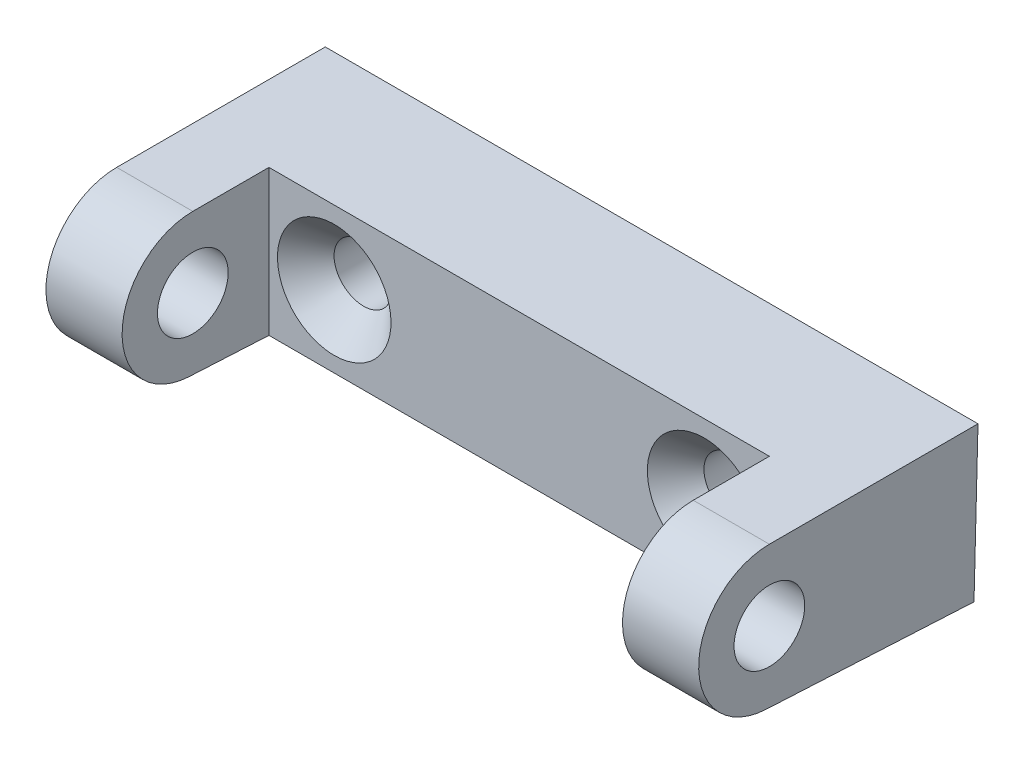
ISO-10303-21;
HEADER;
FILE_DESCRIPTION(('STEP AP214'),'2;1');
FILE_NAME('part.step','',(''),(''),'','','');
FILE_SCHEMA(('AUTOMOTIVE_DESIGN { 1 0 10303 214 1 1 1 1 }'));
ENDSEC;
DATA;
#1=APPLICATION_CONTEXT('core data for automotive mechanical design processes');
#2=APPLICATION_PROTOCOL_DEFINITION('international standard','automotive_design',2000,#1);
#3=PRODUCT_CONTEXT('',#1,'mechanical');
#4=PRODUCT('Part','Part','',(#3));
#5=PRODUCT_RELATED_PRODUCT_CATEGORY('part','',(#4));
#6=PRODUCT_DEFINITION_FORMATION('','',#4);
#7=PRODUCT_DEFINITION_CONTEXT('part definition',#1,'design');
#8=PRODUCT_DEFINITION('design','',#6,#7);
#9=PRODUCT_DEFINITION_SHAPE('','',#8);
#10=(LENGTH_UNIT() NAMED_UNIT(*) SI_UNIT(.MILLI.,.METRE.));
#11=(NAMED_UNIT(*) PLANE_ANGLE_UNIT() SI_UNIT($,.RADIAN.));
#12=(NAMED_UNIT(*) SI_UNIT($,.STERADIAN.) SOLID_ANGLE_UNIT());
#13=UNCERTAINTY_MEASURE_WITH_UNIT(LENGTH_MEASURE(1.E-05),#10,'distance_accuracy_value','');
#14=(GEOMETRIC_REPRESENTATION_CONTEXT(3) GLOBAL_UNCERTAINTY_ASSIGNED_CONTEXT((#13)) GLOBAL_UNIT_ASSIGNED_CONTEXT((#10,
#11,#12)) REPRESENTATION_CONTEXT('',''));
#15=CARTESIAN_POINT('',(0.,0.,0.));
#16=DIRECTION('',(0.,0.,1.));
#17=DIRECTION('',(1.,0.,0.));
#18=AXIS2_PLACEMENT_3D('',#15,#16,#17);
#19=CARTESIAN_POINT('',(47.,6.99759898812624,-0.183325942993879));
#20=DIRECTION('',(0.,-1.,0.));
#21=DIRECTION('',(0.,0.,-1.));
#22=AXIS2_PLACEMENT_3D('',#19,#20,#21);
#23=PLANE('',#22);
#24=DIRECTION('',(0.,0.,1.));
#25=VECTOR('',#24,1.);
#26=CARTESIAN_POINT('',(40.,6.99759898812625,11.9934829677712));
#27=LINE('',#26,#25);
#28=CARTESIAN_POINT('',(40.,6.99759898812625,11.9934829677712));
#29=VERTEX_POINT('',#28);
#30=CARTESIAN_POINT('',(40.,6.99759898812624,18.9934829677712));
#31=VERTEX_POINT('',#30);
#32=EDGE_CURVE('E101',#29,#31,#27,.T.);
#33=ORIENTED_EDGE('',*,*,#32,.T.);
#34=DIRECTION('',(-1.,0.,0.));
#35=VECTOR('',#34,1.);
#36=CARTESIAN_POINT('',(47.,6.99759898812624,18.9934829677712));
#37=LINE('',#36,#35);
#38=CARTESIAN_POINT('',(47.,6.99759898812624,18.9934829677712));
#39=VERTEX_POINT('',#38);
#40=EDGE_CURVE('E138',#39,#31,#37,.T.);
#41=ORIENTED_EDGE('',*,*,#40,.F.);
#42=DIRECTION('',(0.,0.,1.));
#43=VECTOR('',#42,1.);
#44=CARTESIAN_POINT('',(47.,6.99759898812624,-0.183325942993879));
#45=LINE('',#44,#43);
#46=CARTESIAN_POINT('',(47.,6.99759898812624,-0.183325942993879));
#47=VERTEX_POINT('',#46);
#48=EDGE_CURVE('E125',#47,#39,#45,.T.);
#49=ORIENTED_EDGE('',*,*,#48,.F.);
#50=DIRECTION('',(-1.,0.,0.));
#51=VECTOR('',#50,1.);
#52=CARTESIAN_POINT('',(47.,6.99759898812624,-0.183325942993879));
#53=LINE('',#52,#51);
#54=CARTESIAN_POINT('',(-13.,6.99759898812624,-0.183325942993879));
#55=VERTEX_POINT('',#54);
#56=EDGE_CURVE('E141',#47,#55,#53,.T.);
#57=ORIENTED_EDGE('',*,*,#56,.T.);
#58=DIRECTION('',(0.,0.,1.));
#59=VECTOR('',#58,1.);
#60=CARTESIAN_POINT('',(-13.,6.99759898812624,-0.183325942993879));
#61=LINE('',#60,#59);
#62=CARTESIAN_POINT('',(-13.,6.99759898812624,18.9934829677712));
#63=VERTEX_POINT('',#62);
#64=EDGE_CURVE('E114',#55,#63,#61,.T.);
#65=ORIENTED_EDGE('',*,*,#64,.T.);
#66=CARTESIAN_POINT('',(-6.,6.99759898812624,18.9934829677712));
#67=VERTEX_POINT('',#66);
#68=EDGE_CURVE('E100',#67,#63,#37,.T.);
#69=ORIENTED_EDGE('',*,*,#68,.F.);
#70=DIRECTION('',(0.,0.,1.));
#71=VECTOR('',#70,1.);
#72=CARTESIAN_POINT('',(-6.,6.99759898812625,11.9934829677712));
#73=LINE('',#72,#71);
#74=CARTESIAN_POINT('',(-6.,6.99759898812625,11.9934829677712));
#75=VERTEX_POINT('',#74);
#76=EDGE_CURVE('E83',#75,#67,#73,.T.);
#77=ORIENTED_EDGE('',*,*,#76,.F.);
#78=DIRECTION('',(-1.,0.,0.));
#79=VECTOR('',#78,1.);
#80=CARTESIAN_POINT('',(40.,6.99759898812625,11.9934829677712));
#81=LINE('',#80,#79);
#82=EDGE_CURVE('E92',#29,#75,#81,.T.);
#83=ORIENTED_EDGE('',*,*,#82,.F.);
#84=EDGE_LOOP('',(#33,#41,#49,#57,#65,#69,#77,#83));
#85=FACE_BOUND('',#84,.T.);
#86=ADVANCED_FACE('F14',(#85),#23,.F.);
#87=CARTESIAN_POINT('',(47.,0.49759898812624,18.9934829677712));
#88=DIRECTION('',(-1.,0.,0.));
#89=DIRECTION('',(0.,-0.999656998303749,0.0261894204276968));
#90=AXIS2_PLACEMENT_3D('',#87,#88,#89);
#91=CYLINDRICAL_SURFACE('',#90,6.5);
#92=CARTESIAN_POINT('',(40.,0.49759898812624,18.9934829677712));
#93=DIRECTION('',(-1.,0.,0.));
#94=DIRECTION('',(0.,-0.999656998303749,0.0261894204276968));
#95=AXIS2_PLACEMENT_3D('',#92,#93,#94);
#96=CIRCLE('',#95,6.5);
#97=CARTESIAN_POINT('',(40.,-5.99348449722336,19.3338286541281));
#98=VERTEX_POINT('',#97);
#99=EDGE_CURVE('E109',#98,#31,#96,.T.);
#100=ORIENTED_EDGE('',*,*,#99,.F.);
#101=DIRECTION('',(-1.,0.,0.));
#102=VECTOR('',#101,1.);
#103=CARTESIAN_POINT('',(47.,-5.99348449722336,19.3338286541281));
#104=LINE('',#103,#102);
#105=CARTESIAN_POINT('',(47.,-5.99348449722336,19.3338286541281));
#106=VERTEX_POINT('',#105);
#107=EDGE_CURVE('E135',#106,#98,#104,.T.);
#108=ORIENTED_EDGE('',*,*,#107,.F.);
#109=CARTESIAN_POINT('',(47.,0.49759898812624,18.9934829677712));
#110=DIRECTION('',(1.,0.,0.));
#111=DIRECTION('',(0.,0.999656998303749,-0.0261894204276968));
#112=AXIS2_PLACEMENT_3D('',#109,#110,#111);
#113=CIRCLE('',#112,6.5);
#114=EDGE_CURVE('E128',#39,#106,#113,.T.);
#115=ORIENTED_EDGE('',*,*,#114,.F.);
#116=ORIENTED_EDGE('',*,*,#40,.T.);
#117=EDGE_LOOP('',(#100,#108,#115,#116));
#118=FACE_BOUND('',#117,.T.);
#119=ADVANCED_FACE('F247',(#118),#91,.T.);
#120=CARTESIAN_POINT('',(47.,-6.99759898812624,0.183325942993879));
#121=DIRECTION('',(0.,-0.998628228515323,0.0523608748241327));
#122=DIRECTION('',(0.,-0.0523608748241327,-0.998628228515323));
#123=AXIS2_PLACEMENT_3D('',#120,#121,#122);
#124=PLANE('',#123);
#125=ORIENTED_EDGE('',*,*,#107,.T.);
#126=DIRECTION('',(0.,-0.0523608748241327,-0.998628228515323));
#127=VECTOR('',#126,1.);
#128=CARTESIAN_POINT('',(40.,-6.99759898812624,0.183325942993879));
#129=LINE('',#128,#127);
#130=CARTESIAN_POINT('',(40.,-6.3783593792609,11.9934829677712));
#131=VERTEX_POINT('',#130);
#132=EDGE_CURVE('E146',#98,#131,#129,.T.);
#133=ORIENTED_EDGE('',*,*,#132,.T.);
#134=DIRECTION('',(1.,0.,0.));
#135=VECTOR('',#134,1.);
#136=CARTESIAN_POINT('',(47.,-6.3783593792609,11.9934829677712));
#137=LINE('',#136,#135);
#138=CARTESIAN_POINT('',(-6.,-6.3783593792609,11.9934829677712));
#139=VERTEX_POINT('',#138);
#140=EDGE_CURVE('E143',#139,#131,#137,.T.);
#141=ORIENTED_EDGE('',*,*,#140,.F.);
#142=DIRECTION('',(0.,-0.0523608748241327,-0.998628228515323));
#143=VECTOR('',#142,1.);
#144=CARTESIAN_POINT('',(-6.,-6.99759898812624,0.183325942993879));
#145=LINE('',#144,#143);
#146=CARTESIAN_POINT('',(-6.,-5.99348449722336,19.3338286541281));
#147=VERTEX_POINT('',#146);
#148=EDGE_CURVE('E86',#147,#139,#145,.T.);
#149=ORIENTED_EDGE('',*,*,#148,.F.);
#150=CARTESIAN_POINT('',(-13.,-5.99348449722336,19.3338286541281));
#151=VERTEX_POINT('',#150);
#152=EDGE_CURVE('E134',#147,#151,#104,.T.);
#153=ORIENTED_EDGE('',*,*,#152,.T.);
#154=DIRECTION('',(0.,0.0523608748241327,0.998628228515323));
#155=VECTOR('',#154,1.);
#156=CARTESIAN_POINT('',(-13.,-6.99759898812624,0.183325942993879));
#157=LINE('',#156,#155);
#158=CARTESIAN_POINT('',(-13.,-6.99759898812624,0.183325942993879));
#159=VERTEX_POINT('',#158);
#160=EDGE_CURVE('E119',#159,#151,#157,.T.);
#161=ORIENTED_EDGE('',*,*,#160,.F.);
#162=DIRECTION('',(-1.,0.,0.));
#163=VECTOR('',#162,1.);
#164=CARTESIAN_POINT('',(47.,-6.99759898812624,0.183325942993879));
#165=LINE('',#164,#163);
#166=CARTESIAN_POINT('',(47.,-6.99759898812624,0.183325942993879));
#167=VERTEX_POINT('',#166);
#168=EDGE_CURVE('E39',#167,#159,#165,.T.);
#169=ORIENTED_EDGE('',*,*,#168,.F.);
#170=DIRECTION('',(0.,0.0523608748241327,0.998628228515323));
#171=VECTOR('',#170,1.);
#172=CARTESIAN_POINT('',(47.,-6.99759898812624,0.183325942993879));
#173=LINE('',#172,#171);
#174=EDGE_CURVE('E131',#167,#106,#173,.T.);
#175=ORIENTED_EDGE('',*,*,#174,.T.);
#176=EDGE_LOOP('',(#125,#133,#141,#149,#153,#161,#169,#175));
#177=FACE_BOUND('',#176,.T.);
#178=ADVANCED_FACE('F252',(#177),#124,.T.);
#179=CARTESIAN_POINT('',(47.,-6.99759898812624,0.183325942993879));
#180=DIRECTION('',(0.,0.0261894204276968,0.999656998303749));
#181=DIRECTION('',(1.,0.,0.));
#182=AXIS2_PLACEMENT_3D('',#179,#180,#181);
#183=PLANE('',#182);
#184=CARTESIAN_POINT('',(34.,0.,0.));
#185=DIRECTION('',(0.,-0.0261894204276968,-0.999656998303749));
#186=DIRECTION('',(-1.,0.,0.));
#187=AXIS2_PLACEMENT_3D('',#184,#185,#186);
#188=CIRCLE('',#187,2.65);
#189=CARTESIAN_POINT('',(31.35,0.,0.));
#190=VERTEX_POINT('',#189);
#191=EDGE_CURVE('E302',#190,#190,#188,.T.);
#192=ORIENTED_EDGE('',*,*,#191,.F.);
#193=EDGE_LOOP('',(#192));
#194=FACE_BOUND('',#193,.T.);
#195=CARTESIAN_POINT('',(0.,0.,0.));
#196=DIRECTION('',(0.,-0.0261894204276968,-0.999656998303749));
#197=DIRECTION('',(-1.,0.,0.));
#198=AXIS2_PLACEMENT_3D('',#195,#196,#197);
#199=CIRCLE('',#198,2.65);
#200=CARTESIAN_POINT('',(-2.65,0.,0.));
#201=VERTEX_POINT('',#200);
#202=EDGE_CURVE('E103',#201,#201,#199,.T.);
#203=ORIENTED_EDGE('',*,*,#202,.F.);
#204=EDGE_LOOP('',(#203));
#205=FACE_BOUND('',#204,.T.);
#206=ORIENTED_EDGE('',*,*,#56,.F.);
#207=DIRECTION('',(0.,0.999656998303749,-0.0261894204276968));
#208=VECTOR('',#207,1.);
#209=CARTESIAN_POINT('',(47.,-6.99759898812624,0.183325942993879));
#210=LINE('',#209,#208);
#211=EDGE_CURVE('E122',#167,#47,#210,.T.);
#212=ORIENTED_EDGE('',*,*,#211,.F.);
#213=ORIENTED_EDGE('',*,*,#168,.T.);
#214=DIRECTION('',(0.,0.999656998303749,-0.0261894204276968));
#215=VECTOR('',#214,1.);
#216=CARTESIAN_POINT('',(-13.,-6.99759898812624,0.183325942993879));
#217=LINE('',#216,#215);
#218=EDGE_CURVE('E111',#159,#55,#217,.T.);
#219=ORIENTED_EDGE('',*,*,#218,.T.);
#220=EDGE_LOOP('',(#206,#212,#213,#219));
#221=FACE_BOUND('',#220,.T.);
#222=ADVANCED_FACE('F259',(#194,#205,#221),#183,.F.);
#223=CARTESIAN_POINT('',(-6.,0.49759898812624,18.9934829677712));
#224=DIRECTION('',(-1.,0.,0.));
#225=DIRECTION('',(0.,-0.999656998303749,0.0261894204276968));
#226=AXIS2_PLACEMENT_3D('',#223,#224,#225);
#227=CIRCLE('',#226,6.5);
#228=EDGE_CURVE('E88',#147,#67,#227,.T.);
#229=ORIENTED_EDGE('',*,*,#228,.T.);
#230=ORIENTED_EDGE('',*,*,#68,.T.);
#231=CARTESIAN_POINT('',(-13.,0.49759898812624,18.9934829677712));
#232=DIRECTION('',(1.,0.,0.));
#233=DIRECTION('',(0.,0.999656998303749,-0.0261894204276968));
#234=AXIS2_PLACEMENT_3D('',#231,#232,#233);
#235=CIRCLE('',#234,6.5);
#236=EDGE_CURVE('E116',#63,#151,#235,.T.);
#237=ORIENTED_EDGE('',*,*,#236,.T.);
#238=ORIENTED_EDGE('',*,*,#152,.F.);
#239=EDGE_LOOP('',(#229,#230,#237,#238));
#240=FACE_BOUND('',#239,.T.);
#241=ADVANCED_FACE('F254',(#240),#91,.T.);
#242=CARTESIAN_POINT('',(47.,0.49759898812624,18.9934829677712));
#243=DIRECTION('',(1.,0.,0.));
#244=DIRECTION('',(0.,0.999656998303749,-0.0261894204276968));
#245=AXIS2_PLACEMENT_3D('',#242,#243,#244);
#246=PLANE('',#245);
#247=CARTESIAN_POINT('',(47.,0.49759898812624,18.9934829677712));
#248=DIRECTION('',(1.,0.,0.));
#249=DIRECTION('',(0.,0.999656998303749,-0.0261894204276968));
#250=AXIS2_PLACEMENT_3D('',#247,#248,#249);
#251=CIRCLE('',#250,3.25);
#252=CARTESIAN_POINT('',(47.,3.74648423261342,18.9083673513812));
#253=VERTEX_POINT('',#252);
#254=EDGE_CURVE('E294',#253,#253,#251,.T.);
#255=ORIENTED_EDGE('',*,*,#254,.F.);
#256=EDGE_LOOP('',(#255));
#257=FACE_BOUND('',#256,.T.);
#258=ORIENTED_EDGE('',*,*,#211,.T.);
#259=ORIENTED_EDGE('',*,*,#48,.T.);
#260=ORIENTED_EDGE('',*,*,#114,.T.);
#261=ORIENTED_EDGE('',*,*,#174,.F.);
#262=EDGE_LOOP('',(#258,#259,#260,#261));
#263=FACE_BOUND('',#262,.T.);
#264=ADVANCED_FACE('F262',(#257,#263),#246,.T.);
#265=CARTESIAN_POINT('',(-13.,0.49759898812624,18.9934829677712));
#266=DIRECTION('',(1.,0.,0.));
#267=DIRECTION('',(0.,0.999656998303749,-0.0261894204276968));
#268=AXIS2_PLACEMENT_3D('',#265,#266,#267);
#269=PLANE('',#268);
#270=CARTESIAN_POINT('',(-13.,0.49759898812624,18.9934829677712));
#271=DIRECTION('',(1.,0.,0.));
#272=DIRECTION('',(0.,0.999656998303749,-0.0261894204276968));
#273=AXIS2_PLACEMENT_3D('',#270,#271,#272);
#274=CIRCLE('',#273,3.25);
#275=CARTESIAN_POINT('',(-13.,3.74648423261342,18.9083673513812));
#276=VERTEX_POINT('',#275);
#277=EDGE_CURVE('E292',#276,#276,#274,.T.);
#278=ORIENTED_EDGE('',*,*,#277,.T.);
#279=EDGE_LOOP('',(#278));
#280=FACE_BOUND('',#279,.T.);
#281=ORIENTED_EDGE('',*,*,#218,.F.);
#282=ORIENTED_EDGE('',*,*,#160,.T.);
#283=ORIENTED_EDGE('',*,*,#236,.F.);
#284=ORIENTED_EDGE('',*,*,#64,.F.);
#285=EDGE_LOOP('',(#281,#282,#283,#284));
#286=FACE_BOUND('',#285,.T.);
#287=ADVANCED_FACE('F182',(#280,#286),#269,.F.);
#288=CARTESIAN_POINT('',(40.,-6.99759898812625,11.9934829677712));
#289=DIRECTION('',(-1.,0.,0.));
#290=DIRECTION('',(0.,-0.999656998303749,0.0261894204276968));
#291=AXIS2_PLACEMENT_3D('',#288,#289,#290);
#292=PLANE('',#291);
#293=CARTESIAN_POINT('',(40.,0.49759898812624,18.9934829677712));
#294=DIRECTION('',(-1.,0.,0.));
#295=DIRECTION('',(0.,-0.999656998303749,0.0261894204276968));
#296=AXIS2_PLACEMENT_3D('',#293,#294,#295);
#297=CIRCLE('',#296,3.25);
#298=CARTESIAN_POINT('',(40.,-2.75128625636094,19.0785985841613));
#299=VERTEX_POINT('',#298);
#300=EDGE_CURVE('E297',#299,#299,#297,.T.);
#301=ORIENTED_EDGE('',*,*,#300,.F.);
#302=EDGE_LOOP('',(#301));
#303=FACE_BOUND('',#302,.T.);
#304=ORIENTED_EDGE('',*,*,#99,.T.);
#305=ORIENTED_EDGE('',*,*,#32,.F.);
#306=DIRECTION('',(0.,1.,0.));
#307=VECTOR('',#306,1.);
#308=CARTESIAN_POINT('',(40.,-6.99759898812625,11.9934829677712));
#309=LINE('',#308,#307);
#310=EDGE_CURVE('E89',#131,#29,#309,.T.);
#311=ORIENTED_EDGE('',*,*,#310,.F.);
#312=ORIENTED_EDGE('',*,*,#132,.F.);
#313=EDGE_LOOP('',(#304,#305,#311,#312));
#314=FACE_BOUND('',#313,.T.);
#315=ADVANCED_FACE('F179',(#303,#314),#292,.T.);
#316=CARTESIAN_POINT('',(-6.,-6.99759898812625,11.9934829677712));
#317=DIRECTION('',(-1.,0.,0.));
#318=DIRECTION('',(0.,-0.999656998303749,0.0261894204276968));
#319=AXIS2_PLACEMENT_3D('',#316,#317,#318);
#320=PLANE('',#319);
#321=CARTESIAN_POINT('',(-6.,0.49759898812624,18.9934829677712));
#322=DIRECTION('',(-1.,0.,0.));
#323=DIRECTION('',(0.,-0.999656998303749,0.0261894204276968));
#324=AXIS2_PLACEMENT_3D('',#321,#322,#323);
#325=CIRCLE('',#324,3.25);
#326=CARTESIAN_POINT('',(-6.,-2.75128625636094,19.0785985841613));
#327=VERTEX_POINT('',#326);
#328=EDGE_CURVE('E293',#327,#327,#325,.T.);
#329=ORIENTED_EDGE('',*,*,#328,.T.);
#330=EDGE_LOOP('',(#329));
#331=FACE_BOUND('',#330,.T.);
#332=ORIENTED_EDGE('',*,*,#228,.F.);
#333=ORIENTED_EDGE('',*,*,#148,.T.);
#334=DIRECTION('',(0.,1.,0.));
#335=VECTOR('',#334,1.);
#336=CARTESIAN_POINT('',(-6.,-6.99759898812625,11.9934829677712));
#337=LINE('',#336,#335);
#338=EDGE_CURVE('E31',#139,#75,#337,.T.);
#339=ORIENTED_EDGE('',*,*,#338,.T.);
#340=ORIENTED_EDGE('',*,*,#76,.T.);
#341=EDGE_LOOP('',(#332,#333,#339,#340));
#342=FACE_BOUND('',#341,.T.);
#343=ADVANCED_FACE('F81',(#331,#342),#320,.F.);
#344=CARTESIAN_POINT('',(40.,-6.99759898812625,11.9934829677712));
#345=DIRECTION('',(0.,0.,-1.));
#346=DIRECTION('',(0.,1.,0.));
#347=AXIS2_PLACEMENT_3D('',#344,#345,#346);
#348=PLANE('',#347);
#349=CARTESIAN_POINT('',(34.,-4.97473937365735,11.9934829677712));
#350=CARTESIAN_POINT('',(34.0854565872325,-4.97474053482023,11.9934829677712));
#351=CARTESIAN_POINT('',(34.1709099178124,-4.97254947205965,11.9934829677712));
#352=CARTESIAN_POINT('',(34.3415277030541,-4.96385495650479,11.9934829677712));
#353=CARTESIAN_POINT('',(34.4266923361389,-4.95735501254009,11.9934829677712));
#354=CARTESIAN_POINT('',(34.5965486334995,-4.9401187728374,11.9934829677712));
#355=CARTESIAN_POINT('',(34.6812405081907,-4.92938454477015,11.9934829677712));
#356=CARTESIAN_POINT('',(34.849969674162,-4.90375695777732,11.9934829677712));
#357=CARTESIAN_POINT('',(34.9340071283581,-4.888864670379,11.9934829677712));
#358=CARTESIAN_POINT('',(35.1012452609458,-4.85499728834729,11.9934829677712));
#359=CARTESIAN_POINT('',(35.1844460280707,-4.83602263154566,11.9934829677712));
#360=CARTESIAN_POINT('',(35.3498287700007,-4.79406660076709,11.9934829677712));
#361=CARTESIAN_POINT('',(35.4320107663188,-4.77108531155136,11.9934829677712));
#362=CARTESIAN_POINT('',(35.5951738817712,-4.72119179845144,11.9934829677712));
#363=CARTESIAN_POINT('',(35.6761549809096,-4.69427950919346,11.9934829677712));
#364=CARTESIAN_POINT('',(35.8367341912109,-4.6365995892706,11.9934829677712));
#365=CARTESIAN_POINT('',(35.9163322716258,-4.60583187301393,11.9934829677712));
#366=CARTESIAN_POINT('',(36.073963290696,-4.54051656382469,11.9934829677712));
#367=CARTESIAN_POINT('',(36.1519962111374,-4.50596892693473,11.9934829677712));
#368=CARTESIAN_POINT('',(36.3063147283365,-4.43316918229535,11.9934829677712));
#369=CARTESIAN_POINT('',(36.3826003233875,-4.39491707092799,11.9934829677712));
#370=CARTESIAN_POINT('',(36.5332420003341,-4.31478378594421,11.9934829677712));
#371=CARTESIAN_POINT('',(36.6075980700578,-4.27290258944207,11.9934829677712));
#372=CARTESIAN_POINT('',(36.754198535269,-4.18558660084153,11.9934829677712));
#373=CARTESIAN_POINT('',(36.8264428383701,-4.14015165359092,11.9934829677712));
#374=CARTESIAN_POINT('',(36.9686376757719,-4.04580374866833,11.9934829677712));
#375=CARTESIAN_POINT('',(37.0385879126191,-3.99689034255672,11.9934829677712));
#376=CARTESIAN_POINT('',(37.1760126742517,-3.89566124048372,11.9934829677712));
#377=CARTESIAN_POINT('',(37.2434865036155,-3.84334460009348,11.9934829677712));
#378=CARTESIAN_POINT('',(37.3757766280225,-3.73538503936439,11.9934829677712));
#379=CARTESIAN_POINT('',(37.4405915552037,-3.67974044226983,11.9934829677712));
#380=CARTESIAN_POINT('',(37.5673826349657,-3.56520087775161,11.9934829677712));
#381=CARTESIAN_POINT('',(37.6293563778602,-3.50630324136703,11.9934829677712));
#382=CARTESIAN_POINT('',(37.7502075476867,-3.38541060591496,11.9934829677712));
#383=CARTESIAN_POINT('',(37.8090849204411,-3.32341555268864,11.9934829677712));
#384=CARTESIAN_POINT('',(37.9235851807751,-3.19658098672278,11.9934829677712));
#385=CARTESIAN_POINT('',(37.9792106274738,-3.13174378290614,11.9934829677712));
#386=CARTESIAN_POINT('',(38.0871331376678,-2.9994082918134,11.9934829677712));
#387=CARTESIAN_POINT('',(38.1394317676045,-2.93191128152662,11.9934829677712));
#388=CARTESIAN_POINT('',(38.2406261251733,-2.79443939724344,11.9934829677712));
#389=CARTESIAN_POINT('',(38.2895226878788,-2.72446513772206,11.9934829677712));
#390=CARTESIAN_POINT('',(38.3838382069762,-2.58222154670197,11.9934829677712));
#391=CARTESIAN_POINT('',(38.4292575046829,-2.50995244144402,11.9934829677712));
#392=CARTESIAN_POINT('',(38.5165435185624,-2.36330171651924,11.9934829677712));
#393=CARTESIAN_POINT('',(38.558410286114,-2.28892012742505,11.9934829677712));
#394=CARTESIAN_POINT('',(38.6385160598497,-2.13822680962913,11.9934829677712));
#395=CARTESIAN_POINT('',(38.6767549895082,-2.06191504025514,11.9934829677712));
#396=CARTESIAN_POINT('',(38.7495297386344,-1.90754362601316,11.9934829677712));
#397=CARTESIAN_POINT('',(38.7840654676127,-1.82948393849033,11.9934829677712));
#398=CARTESIAN_POINT('',(38.8493583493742,-1.67179889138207,11.9934829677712));
#399=CARTESIAN_POINT('',(38.8801154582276,-1.59217351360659,11.9934829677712));
#400=CARTESIAN_POINT('',(38.9377755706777,-1.43153926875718,11.9934829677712));
#401=CARTESIAN_POINT('',(38.9646785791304,-1.35053040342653,11.9934829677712));
#402=CARTESIAN_POINT('',(39.0145549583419,-1.18731137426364,11.9934829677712));
#403=CARTESIAN_POINT('',(39.0375283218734,-1.10510120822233,11.9934829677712));
#404=CARTESIAN_POINT('',(39.0794699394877,-0.939661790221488,11.9934829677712));
#405=CARTESIAN_POINT('',(39.0984380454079,-0.856432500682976,11.9934829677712));
#406=CARTESIAN_POINT('',(39.1322938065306,-0.689137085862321,11.9934829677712));
#407=CARTESIAN_POINT('',(39.1471809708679,-0.605070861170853,11.9934829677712));
#408=CARTESIAN_POINT('',(39.1727997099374,-0.436283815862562,11.9934829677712));
#409=CARTESIAN_POINT('',(39.1835301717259,-0.351562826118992,11.9934829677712));
#410=CARTESIAN_POINT('',(39.2007606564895,-0.181648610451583,11.9934829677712));
#411=CARTESIAN_POINT('',(39.2072585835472,-0.0964551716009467,11.9934829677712));
#412=CARTESIAN_POINT('',(39.2159494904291,0.0742220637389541,11.9934829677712));
#413=CARTESIAN_POINT('',(39.2181389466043,0.159706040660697,11.9934829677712));
#414=CARTESIAN_POINT('',(39.2181389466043,0.33067399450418,11.9934829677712));
#415=CARTESIAN_POINT('',(39.2159494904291,0.416157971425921,11.9934829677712));
#416=CARTESIAN_POINT('',(39.2072585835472,0.58683520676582,11.9934829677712));
#417=CARTESIAN_POINT('',(39.2007606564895,0.672028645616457,11.9934829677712));
#418=CARTESIAN_POINT('',(39.1835301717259,0.841942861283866,11.9934829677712));
#419=CARTESIAN_POINT('',(39.1727997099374,0.926663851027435,11.9934829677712));
#420=CARTESIAN_POINT('',(39.1471809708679,1.09545089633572,11.9934829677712));
#421=CARTESIAN_POINT('',(39.1322938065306,1.17951712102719,11.9934829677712));
#422=CARTESIAN_POINT('',(39.0984380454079,1.34681253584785,11.9934829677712));
#423=CARTESIAN_POINT('',(39.0794699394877,1.43004182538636,11.9934829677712));
#424=CARTESIAN_POINT('',(39.0375283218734,1.5954812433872,11.9934829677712));
#425=CARTESIAN_POINT('',(39.0145549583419,1.67769140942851,11.9934829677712));
#426=CARTESIAN_POINT('',(38.9646785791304,1.8409104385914,11.9934829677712));
#427=CARTESIAN_POINT('',(38.9377755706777,1.92191930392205,11.9934829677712));
#428=CARTESIAN_POINT('',(38.8801154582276,2.08255354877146,11.9934829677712));
#429=CARTESIAN_POINT('',(38.8493583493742,2.16217892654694,11.9934829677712));
#430=CARTESIAN_POINT('',(38.7840654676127,2.3198639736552,11.9934829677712));
#431=CARTESIAN_POINT('',(38.7495297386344,2.39792366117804,11.9934829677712));
#432=CARTESIAN_POINT('',(38.6767549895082,2.55229507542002,11.9934829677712));
#433=CARTESIAN_POINT('',(38.6385160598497,2.628606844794,11.9934829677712));
#434=CARTESIAN_POINT('',(38.558410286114,2.77930016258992,11.9934829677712));
#435=CARTESIAN_POINT('',(38.5165435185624,2.85368175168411,11.9934829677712));
#436=CARTESIAN_POINT('',(38.4292575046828,3.00033247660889,11.9934829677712));
#437=CARTESIAN_POINT('',(38.3838382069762,3.07260158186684,11.9934829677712));
#438=CARTESIAN_POINT('',(38.2895226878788,3.21484517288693,11.9934829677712));
#439=CARTESIAN_POINT('',(38.2406261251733,3.2848194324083,11.9934829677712));
#440=CARTESIAN_POINT('',(38.1394317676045,3.42229131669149,11.9934829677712));
#441=CARTESIAN_POINT('',(38.0871331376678,3.48978832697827,11.9934829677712));
#442=CARTESIAN_POINT('',(37.9792106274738,3.62212381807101,11.9934829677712));
#443=CARTESIAN_POINT('',(37.923585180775,3.68696102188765,11.9934829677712));
#444=CARTESIAN_POINT('',(37.8090849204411,3.81379558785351,11.9934829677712));
#445=CARTESIAN_POINT('',(37.7502075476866,3.87579064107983,11.9934829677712));
#446=CARTESIAN_POINT('',(37.6293563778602,3.9966832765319,11.9934829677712));
#447=CARTESIAN_POINT('',(37.5673826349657,4.05558091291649,11.9934829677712));
#448=CARTESIAN_POINT('',(37.4405915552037,4.1701204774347,11.9934829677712));
#449=CARTESIAN_POINT('',(37.3757766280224,4.22576507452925,11.9934829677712));
#450=CARTESIAN_POINT('',(37.2434865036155,4.33372463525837,11.9934829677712));
#451=CARTESIAN_POINT('',(37.1760126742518,4.38604127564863,11.9934829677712));
#452=CARTESIAN_POINT('',(37.038587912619,4.48727037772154,11.9934829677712));
#453=CARTESIAN_POINT('',(36.9686376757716,4.53618378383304,11.9934829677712));
#454=CARTESIAN_POINT('',(36.8264428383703,4.63053168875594,11.9934829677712));
#455=CARTESIAN_POINT('',(36.7541985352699,4.67596663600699,11.9934829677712));
#456=CARTESIAN_POINT('',(36.6075980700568,4.76328262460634,11.9934829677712));
#457=CARTESIAN_POINT('',(36.5332420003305,4.80516382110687,11.9934829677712));
#458=CARTESIAN_POINT('',(36.3826003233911,4.88529710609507,11.9934829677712));
#459=CARTESIAN_POINT('',(36.3063147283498,4.92354921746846,11.9934829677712));
#460=CARTESIAN_POINT('',(36.151996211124,4.99634896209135,11.9934829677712));
#461=CARTESIAN_POINT('',(36.0739632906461,5.03089659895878,11.9934829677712));
#462=CARTESIAN_POINT('',(35.9163322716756,5.09621190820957,11.9934829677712));
#463=CARTESIAN_POINT('',(35.8367341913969,5.12697962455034,11.9934829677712));
#464=CARTESIAN_POINT('',(35.6761549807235,5.18465954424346,11.9934829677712));
#465=CARTESIAN_POINT('',(35.5951738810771,5.21157183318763,11.9934829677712));
#466=CARTESIAN_POINT('',(35.4320107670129,5.2614653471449,11.9934829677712));
#467=CARTESIAN_POINT('',(35.3498287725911,5.28444663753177,11.9934829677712));
#468=CARTESIAN_POINT('',(35.1844460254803,5.32640266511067,11.9934829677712));
#469=CARTESIAN_POINT('',(35.1012452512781,5.34537731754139,11.9934829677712));
#470=CARTESIAN_POINT('',(34.9340071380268,5.37924471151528,11.9934829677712));
#471=CARTESIAN_POINT('',(34.8499697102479,5.39413701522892,11.9934829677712));
#472=CARTESIAN_POINT('',(34.6812404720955,5.41976455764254,11.9934829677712));
#473=CARTESIAN_POINT('',(34.5965484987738,5.43049872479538,11.9934829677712));
#474=CARTESIAN_POINT('',(34.4266924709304,5.44773513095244,11.9934829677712));
#475=CARTESIAN_POINT('',(34.3415282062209,5.45423530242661,11.9934829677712));
#476=CARTESIAN_POINT('',(34.1709094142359,5.46292919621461,11.9934829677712));
#477=CARTESIAN_POINT('',(34.085454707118,5.46511940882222,11.9934829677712));
#478=CARTESIAN_POINT('',(33.914545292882,5.46511940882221,11.9934829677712));
#479=CARTESIAN_POINT('',(33.829090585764,5.4629291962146,11.9934829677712));
#480=CARTESIAN_POINT('',(33.6584717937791,5.4542353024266,11.9934829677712));
#481=CARTESIAN_POINT('',(33.5733075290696,5.44773513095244,11.9934829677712));
#482=CARTESIAN_POINT('',(33.4034515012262,5.43049872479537,11.9934829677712));
#483=CARTESIAN_POINT('',(33.3187595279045,5.41976455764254,11.9934829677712));
#484=CARTESIAN_POINT('',(33.1500302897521,5.39413701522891,11.9934829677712));
#485=CARTESIAN_POINT('',(33.0659928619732,5.37924471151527,11.9934829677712));
#486=CARTESIAN_POINT('',(32.8987547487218,5.34537731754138,11.9934829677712));
#487=CARTESIAN_POINT('',(32.8155539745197,5.32640266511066,11.9934829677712));
#488=CARTESIAN_POINT('',(32.6501712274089,5.28444663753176,11.9934829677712));
#489=CARTESIAN_POINT('',(32.5679892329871,5.26146534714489,11.9934829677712));
#490=CARTESIAN_POINT('',(32.4048261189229,5.21157183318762,11.9934829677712));
#491=CARTESIAN_POINT('',(32.3238450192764,5.18465954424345,11.9934829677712));
#492=CARTESIAN_POINT('',(32.1632658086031,5.12697962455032,11.9934829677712));
#493=CARTESIAN_POINT('',(32.0836677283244,5.09621190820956,11.9934829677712));
#494=CARTESIAN_POINT('',(31.9260367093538,5.03089659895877,11.9934829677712));
#495=CARTESIAN_POINT('',(31.848003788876,4.99634896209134,11.9934829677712));
#496=CARTESIAN_POINT('',(31.6936852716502,4.92354921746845,11.9934829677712));
#497=CARTESIAN_POINT('',(31.6173996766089,4.88529710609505,11.9934829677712));
#498=CARTESIAN_POINT('',(31.4667579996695,4.80516382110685,11.9934829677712));
#499=CARTESIAN_POINT('',(31.3924019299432,4.76328262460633,11.9934829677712));
#500=CARTESIAN_POINT('',(31.2458014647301,4.67596663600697,11.9934829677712));
#501=CARTESIAN_POINT('',(31.1735571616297,4.63053168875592,11.9934829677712));
#502=CARTESIAN_POINT('',(31.0313623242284,4.53618378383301,11.9934829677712));
#503=CARTESIAN_POINT('',(30.961412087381,4.48727037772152,11.9934829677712));
#504=CARTESIAN_POINT('',(30.8239873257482,4.38604127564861,11.9934829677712));
#505=CARTESIAN_POINT('',(30.7565134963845,4.33372463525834,11.9934829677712));
#506=CARTESIAN_POINT('',(30.6242233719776,4.22576507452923,11.9934829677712));
#507=CARTESIAN_POINT('',(30.5594084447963,4.17012047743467,11.9934829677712));
#508=CARTESIAN_POINT('',(30.4326173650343,4.05558091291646,11.9934829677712));
#509=CARTESIAN_POINT('',(30.3706436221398,3.99668327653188,11.9934829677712));
#510=CARTESIAN_POINT('',(30.2497924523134,3.87579064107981,11.9934829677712));
#511=CARTESIAN_POINT('',(30.1909150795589,3.81379558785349,11.9934829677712));
#512=CARTESIAN_POINT('',(30.076414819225,3.68696102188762,11.9934829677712));
#513=CARTESIAN_POINT('',(30.0207893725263,3.62212381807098,11.9934829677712));
#514=CARTESIAN_POINT('',(29.9128668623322,3.48978832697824,11.9934829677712));
#515=CARTESIAN_POINT('',(29.8605682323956,3.42229131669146,11.9934829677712));
#516=CARTESIAN_POINT('',(29.7593738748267,3.28481943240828,11.9934829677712));
#517=CARTESIAN_POINT('',(29.7104773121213,3.21484517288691,11.9934829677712));
#518=CARTESIAN_POINT('',(29.6161617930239,3.07260158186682,11.9934829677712));
#519=CARTESIAN_POINT('',(29.5707424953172,3.00033247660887,11.9934829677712));
#520=CARTESIAN_POINT('',(29.4834564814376,2.85368175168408,11.9934829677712));
#521=CARTESIAN_POINT('',(29.4415897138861,2.7793001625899,11.9934829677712));
#522=CARTESIAN_POINT('',(29.3614839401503,2.62860684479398,11.9934829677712));
#523=CARTESIAN_POINT('',(29.3232450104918,2.55229507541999,11.9934829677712));
#524=CARTESIAN_POINT('',(29.2504702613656,2.39792366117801,11.9934829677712));
#525=CARTESIAN_POINT('',(29.2159345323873,2.31986397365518,11.9934829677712));
#526=CARTESIAN_POINT('',(29.1506416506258,2.16217892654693,11.9934829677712));
#527=CARTESIAN_POINT('',(29.1198845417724,2.08255354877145,11.9934829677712));
#528=CARTESIAN_POINT('',(29.0622244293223,1.92191930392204,11.9934829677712));
#529=CARTESIAN_POINT('',(29.0353214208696,1.84091043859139,11.9934829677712));
#530=CARTESIAN_POINT('',(28.9854450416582,1.6776914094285,11.9934829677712));
#531=CARTESIAN_POINT('',(28.9624716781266,1.59548124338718,11.9934829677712));
#532=CARTESIAN_POINT('',(28.9205300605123,1.43004182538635,11.9934829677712));
#533=CARTESIAN_POINT('',(28.9015619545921,1.34681253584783,11.9934829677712));
#534=CARTESIAN_POINT('',(28.8677061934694,1.17951712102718,11.9934829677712));
#535=CARTESIAN_POINT('',(28.8528190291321,1.09545089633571,11.9934829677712));
#536=CARTESIAN_POINT('',(28.8272002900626,0.926663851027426,11.9934829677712));
#537=CARTESIAN_POINT('',(28.8164698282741,0.841942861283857,11.9934829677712));
#538=CARTESIAN_POINT('',(28.7992393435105,0.672028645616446,11.9934829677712));
#539=CARTESIAN_POINT('',(28.7927414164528,0.586835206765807,11.9934829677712));
#540=CARTESIAN_POINT('',(28.7840505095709,0.416157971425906,11.9934829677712));
#541=CARTESIAN_POINT('',(28.7818610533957,0.330673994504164,11.9934829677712));
#542=CARTESIAN_POINT('',(28.7818610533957,0.159706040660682,11.9934829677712));
#543=CARTESIAN_POINT('',(28.7840505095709,0.0742220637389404,11.9934829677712));
#544=CARTESIAN_POINT('',(28.7927414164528,-0.0964551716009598,11.9934829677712));
#545=CARTESIAN_POINT('',(28.7992393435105,-0.181648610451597,11.9934829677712));
#546=CARTESIAN_POINT('',(28.8164698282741,-0.351562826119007,11.9934829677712));
#547=CARTESIAN_POINT('',(28.8272002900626,-0.436283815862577,11.9934829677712));
#548=CARTESIAN_POINT('',(28.8528190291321,-0.605070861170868,11.9934829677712));
#549=CARTESIAN_POINT('',(28.8677061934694,-0.689137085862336,11.9934829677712));
#550=CARTESIAN_POINT('',(28.9015619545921,-0.856432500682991,11.9934829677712));
#551=CARTESIAN_POINT('',(28.9205300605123,-0.939661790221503,11.9934829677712));
#552=CARTESIAN_POINT('',(28.9624716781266,-1.10510120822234,11.9934829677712));
#553=CARTESIAN_POINT('',(28.9854450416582,-1.18731137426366,11.9934829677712));
#554=CARTESIAN_POINT('',(29.0353214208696,-1.35053040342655,11.9934829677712));
#555=CARTESIAN_POINT('',(29.0622244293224,-1.43153926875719,11.9934829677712));
#556=CARTESIAN_POINT('',(29.1198845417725,-1.59217351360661,11.9934829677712));
#557=CARTESIAN_POINT('',(29.1506416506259,-1.67179889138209,11.9934829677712));
#558=CARTESIAN_POINT('',(29.2159345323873,-1.82948393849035,11.9934829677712));
#559=CARTESIAN_POINT('',(29.2504702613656,-1.90754362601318,11.9934829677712));
#560=CARTESIAN_POINT('',(29.3232450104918,-2.06191504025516,11.9934829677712));
#561=CARTESIAN_POINT('',(29.3614839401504,-2.13822680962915,11.9934829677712));
#562=CARTESIAN_POINT('',(29.4415897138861,-2.28892012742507,11.9934829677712));
#563=CARTESIAN_POINT('',(29.4834564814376,-2.36330171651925,11.9934829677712));
#564=CARTESIAN_POINT('',(29.5707424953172,-2.50995244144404,11.9934829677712));
#565=CARTESIAN_POINT('',(29.6161617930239,-2.58222154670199,11.9934829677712));
#566=CARTESIAN_POINT('',(29.7104773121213,-2.72446513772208,11.9934829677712));
#567=CARTESIAN_POINT('',(29.7593738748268,-2.79443939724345,11.9934829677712));
#568=CARTESIAN_POINT('',(29.8605682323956,-2.93191128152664,11.9934829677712));
#569=CARTESIAN_POINT('',(29.9128668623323,-2.99940829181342,11.9934829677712));
#570=CARTESIAN_POINT('',(30.0207893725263,-3.13174378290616,11.9934829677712));
#571=CARTESIAN_POINT('',(30.076414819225,-3.1965809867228,11.9934829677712));
#572=CARTESIAN_POINT('',(30.1909150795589,-3.32341555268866,11.9934829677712));
#573=CARTESIAN_POINT('',(30.2497924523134,-3.38541060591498,11.9934829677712));
#574=CARTESIAN_POINT('',(30.3706436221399,-3.50630324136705,11.9934829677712));
#575=CARTESIAN_POINT('',(30.4326173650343,-3.56520087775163,11.9934829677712));
#576=CARTESIAN_POINT('',(30.5594084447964,-3.67974044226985,11.9934829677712));
#577=CARTESIAN_POINT('',(30.6242233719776,-3.73538503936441,11.9934829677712));
#578=CARTESIAN_POINT('',(30.7565134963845,-3.84334460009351,11.9934829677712));
#579=CARTESIAN_POINT('',(30.8239873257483,-3.89566124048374,11.9934829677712));
#580=CARTESIAN_POINT('',(30.961412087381,-3.99689034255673,11.9934829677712));
#581=CARTESIAN_POINT('',(31.0313623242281,-4.04580374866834,11.9934829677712));
#582=CARTESIAN_POINT('',(31.17355716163,-4.14015165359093,11.9934829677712));
#583=CARTESIAN_POINT('',(31.2458014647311,-4.18558660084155,11.9934829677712));
#584=CARTESIAN_POINT('',(31.3924019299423,-4.27290258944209,11.9934829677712));
#585=CARTESIAN_POINT('',(31.466757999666,-4.31478378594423,11.9934829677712));
#586=CARTESIAN_POINT('',(31.6173996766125,-4.39491707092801,11.9934829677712));
#587=CARTESIAN_POINT('',(31.6936852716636,-4.43316918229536,11.9934829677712));
#588=CARTESIAN_POINT('',(31.8480037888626,-4.50596892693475,11.9934829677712));
#589=CARTESIAN_POINT('',(31.926036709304,-4.5405165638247,11.9934829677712));
#590=CARTESIAN_POINT('',(32.0836677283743,-4.60583187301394,11.9934829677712));
#591=CARTESIAN_POINT('',(32.1632658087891,-4.63659958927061,11.9934829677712));
#592=CARTESIAN_POINT('',(32.3238450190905,-4.69427950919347,11.9934829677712));
#593=CARTESIAN_POINT('',(32.4048261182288,-4.72119179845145,11.9934829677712));
#594=CARTESIAN_POINT('',(32.5679892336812,-4.77108531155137,11.9934829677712));
#595=CARTESIAN_POINT('',(32.6501712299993,-4.7940666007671,11.9934829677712));
#596=CARTESIAN_POINT('',(32.8155539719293,-4.83602263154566,11.9934829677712));
#597=CARTESIAN_POINT('',(32.8987547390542,-4.8549972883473,11.9934829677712));
#598=CARTESIAN_POINT('',(33.0659928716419,-4.88886467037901,11.9934829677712));
#599=CARTESIAN_POINT('',(33.150030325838,-4.90375695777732,11.9934829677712));
#600=CARTESIAN_POINT('',(33.3187594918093,-4.92938454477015,11.9934829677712));
#601=CARTESIAN_POINT('',(33.4034513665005,-4.9401187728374,11.9934829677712));
#602=CARTESIAN_POINT('',(33.5733076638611,-4.95735501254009,11.9934829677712));
#603=CARTESIAN_POINT('',(33.6584722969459,-4.96385495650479,11.9934829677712));
#604=CARTESIAN_POINT('',(33.8290900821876,-4.97254947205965,11.9934829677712));
#605=CARTESIAN_POINT('',(33.9145434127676,-4.97474053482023,11.9934829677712));
#606=CARTESIAN_POINT('',(34.,-4.97473937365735,11.9934829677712));
#607=B_SPLINE_CURVE_WITH_KNOTS('',3,(#349,#350,#351,#352,#353,#354,#355,#356,#357,#358,#359,
#360,#361,#362,#363,#364,#365,#366,#367,#368,#369,#370,#371,#372,#373,#374,#375,#376,#377,#378,
#379,#380,#381,#382,#383,#384,#385,#386,#387,#388,#389,#390,#391,#392,#393,#394,#395,#396,#397,
#398,#399,#400,#401,#402,#403,#404,#405,#406,#407,#408,#409,#410,#411,#412,#413,#414,#415,#416,
#417,#418,#419,#420,#421,#422,#423,#424,#425,#426,#427,#428,#429,#430,#431,#432,#433,#434,#435,
#436,#437,#438,#439,#440,#441,#442,#443,#444,#445,#446,#447,#448,#449,#450,#451,#452,#453,#454,
#455,#456,#457,#458,#459,#460,#461,#462,#463,#464,#465,#466,#467,#468,#469,#470,#471,#472,#473,
#474,#475,#476,#477,#478,#479,#480,#481,#482,#483,#484,#485,#486,#487,#488,#489,#490,#491,#492,
#493,#494,#495,#496,#497,#498,#499,#500,#501,#502,#503,#504,#505,#506,#507,#508,#509,#510,#511,
#512,#513,#514,#515,#516,#517,#518,#519,#520,#521,#522,#523,#524,#525,#526,#527,#528,#529,#530,
#531,#532,#533,#534,#535,#536,#537,#538,#539,#540,#541,#542,#543,#544,#545,#546,#547,#548,#549,
#550,#551,#552,#553,#554,#555,#556,#557,#558,#559,#560,#561,#562,#563,#564,#565,#566,#567,#568,
#569,#570,#571,#572,#573,#574,#575,#576,#577,#578,#579,#580,#581,#582,#583,#584,#585,#586,#587,
#588,#589,#590,#591,#592,#593,#594,#595,#596,#597,#598,#599,#600,#601,#602,#603,#604,#605,#606),
.UNSPECIFIED.,.F.,.F.,(4,2,2,2,2,2,2,2,2,2,2,2,2,2,2,2,2,2,2,2,2,2,2,2,2,2,2,2,2,2,2,2,2,2,2,2,
2,2,2,2,2,2,2,2,2,2,2,2,2,2,2,2,2,2,2,2,2,2,2,2,2,2,2,2,2,2,2,2,2,2,2,2,2,2,2,2,2,2,2,2,2,2,2,2,
2,2,2,2,2,2,2,2,2,2,2,2,2,2,2,2,2,2,2,2,2,2,2,2,2,2,2,2,2,2,2,2,2,2,2,2,2,2,2,2,2,2,2,2,4),(0.,
0.256336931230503,0.512465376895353,0.76846890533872,1.0244065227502,1.28031670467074,
1.53622147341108,1.79213049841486,2.04804520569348,2.30396288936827,2.55988082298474,
2.81580037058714,3.07173109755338,3.32769487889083,3.58372999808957,3.83989522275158,
4.09627383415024,4.35265692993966,4.60883546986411,4.86489248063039,5.12088641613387,
5.3768551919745,5.63282026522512,5.88879073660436,6.14476746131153,6.40074716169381,
6.65672653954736,6.91270638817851,7.16869570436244,7.42471579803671,7.68080439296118,
7.93701970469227,8.19344447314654,8.44986924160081,8.70608455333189,8.96217314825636,
9.21819324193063,9.47418255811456,9.73016240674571,9.98614178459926,10.2421214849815,
10.4980982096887,10.754068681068,11.0100337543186,11.2660025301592,11.5219964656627,
11.778053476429,12.0342320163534,12.2906151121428,12.5469937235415,12.8031589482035,
13.0591940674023,13.3151578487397,13.5710885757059,13.8270081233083,14.0829260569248,
14.3388437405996,14.5947584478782,14.850667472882,15.1065722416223,15.3624824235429,
15.6184200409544,15.8744235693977,16.1305520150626,16.3868889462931,16.6432258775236,
16.8993543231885,17.1553578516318,17.4112954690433,17.6672056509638,17.9231104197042,
18.1790194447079,18.4349341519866,18.6908518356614,18.9467697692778,19.2026893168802,
19.4586200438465,19.7145838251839,19.9706189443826,20.2267841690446,20.4831627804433,
20.7395458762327,20.9957244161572,21.2517814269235,21.5077753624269,21.7637441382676,
22.0197092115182,22.2756796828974,22.5316564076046,22.7876361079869,23.0436154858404,
23.2995953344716,23.5555846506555,23.8116047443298,24.0676933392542,24.3239086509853,
24.5803334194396,24.8367581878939,25.0929734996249,25.3490620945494,25.6050821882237,
25.8610715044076,26.1170513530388,26.3730307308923,26.6290104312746,26.8849871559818,
27.140957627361,27.3969227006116,27.6528914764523,27.9088854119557,28.164942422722,
28.4211209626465,28.6775040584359,28.9338826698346,29.1900478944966,29.4460830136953,
29.7020467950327,29.957977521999,30.2138970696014,30.4698150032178,30.7257326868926,
30.9816473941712,31.237556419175,31.4934611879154,31.7493713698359,32.0053089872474,
32.2613125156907,32.5174409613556,32.7737778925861),.UNSPECIFIED.);
#608=CARTESIAN_POINT('',(34.,-4.97473937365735,11.9934829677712));
#609=VERTEX_POINT('',#608);
#610=EDGE_CURVE('E24',#609,#609,#607,.F.);
#611=ORIENTED_EDGE('',*,*,#610,.T.);
#612=EDGE_LOOP('',(#611));
#613=FACE_BOUND('',#612,.T.);
#614=CARTESIAN_POINT('',(0.,-4.97473937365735,11.9934829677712));
#615=CARTESIAN_POINT('',(0.0854565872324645,-4.97474053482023,11.9934829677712));
#616=CARTESIAN_POINT('',(0.170909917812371,-4.97254947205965,11.9934829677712));
#617=CARTESIAN_POINT('',(0.341527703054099,-4.96385495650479,11.9934829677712));
#618=CARTESIAN_POINT('',(0.426692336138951,-4.95735501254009,11.9934829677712));
#619=CARTESIAN_POINT('',(0.596548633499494,-4.9401187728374,11.9934829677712));
#620=CARTESIAN_POINT('',(0.681240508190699,-4.92938454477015,11.9934829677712));
#621=CARTESIAN_POINT('',(0.849969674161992,-4.90375695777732,11.9934829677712));
#622=CARTESIAN_POINT('',(0.934007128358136,-4.888864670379,11.9934829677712));
#623=CARTESIAN_POINT('',(1.10124526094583,-4.85499728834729,11.9934829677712));
#624=CARTESIAN_POINT('',(1.18444602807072,-4.83602263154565,11.9934829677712));
#625=CARTESIAN_POINT('',(1.34982877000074,-4.79406660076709,11.9934829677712));
#626=CARTESIAN_POINT('',(1.4320107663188,-4.77108531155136,11.9934829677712));
#627=CARTESIAN_POINT('',(1.59517388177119,-4.72119179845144,11.9934829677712));
#628=CARTESIAN_POINT('',(1.67615498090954,-4.69427950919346,11.9934829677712));
#629=CARTESIAN_POINT('',(1.8367341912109,-4.6365995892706,11.9934829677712));
#630=CARTESIAN_POINT('',(1.91633227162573,-4.60583187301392,11.9934829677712));
#631=CARTESIAN_POINT('',(2.07396329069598,-4.54051656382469,11.9934829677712));
#632=CARTESIAN_POINT('',(2.15199621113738,-4.50596892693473,11.9934829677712));
#633=CARTESIAN_POINT('',(2.30631472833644,-4.43316918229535,11.9934829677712));
#634=CARTESIAN_POINT('',(2.3826003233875,-4.39491707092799,11.9934829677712));
#635=CARTESIAN_POINT('',(2.53324200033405,-4.31478378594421,11.9934829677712));
#636=CARTESIAN_POINT('',(2.60759807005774,-4.27290258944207,11.9934829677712));
#637=CARTESIAN_POINT('',(2.75419853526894,-4.18558660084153,11.9934829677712));
#638=CARTESIAN_POINT('',(2.82644283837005,-4.14015165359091,11.9934829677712));
#639=CARTESIAN_POINT('',(2.96863767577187,-4.04580374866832,11.9934829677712));
#640=CARTESIAN_POINT('',(3.03858791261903,-3.99689034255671,11.9934829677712));
#641=CARTESIAN_POINT('',(3.17601267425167,-3.89566124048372,11.9934829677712));
#642=CARTESIAN_POINT('',(3.2434865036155,-3.84334460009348,11.9934829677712));
#643=CARTESIAN_POINT('',(3.37577662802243,-3.73538503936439,11.9934829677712));
#644=CARTESIAN_POINT('',(3.44059155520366,-3.67974044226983,11.9934829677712));
#645=CARTESIAN_POINT('',(3.56738263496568,-3.56520087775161,11.9934829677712));
#646=CARTESIAN_POINT('',(3.62935637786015,-3.50630324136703,11.9934829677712));
#647=CARTESIAN_POINT('',(3.75020754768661,-3.38541060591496,11.9934829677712));
#648=CARTESIAN_POINT('',(3.80908492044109,-3.32341555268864,11.9934829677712));
#649=CARTESIAN_POINT('',(3.923585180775,-3.19658098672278,11.9934829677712));
#650=CARTESIAN_POINT('',(3.97921062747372,-3.13174378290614,11.9934829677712));
#651=CARTESIAN_POINT('',(4.08713313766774,-2.9994082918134,11.9934829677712));
#652=CARTESIAN_POINT('',(4.13943176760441,-2.93191128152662,11.9934829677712));
#653=CARTESIAN_POINT('',(4.24062612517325,-2.79443939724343,11.9934829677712));
#654=CARTESIAN_POINT('',(4.28952268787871,-2.72446513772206,11.9934829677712));
#655=CARTESIAN_POINT('',(4.38383820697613,-2.58222154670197,11.9934829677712));
#656=CARTESIAN_POINT('',(4.4292575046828,-2.50995244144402,11.9934829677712));
#657=CARTESIAN_POINT('',(4.51654351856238,-2.36330171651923,11.9934829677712));
#658=CARTESIAN_POINT('',(4.55841028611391,-2.28892012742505,11.9934829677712));
#659=CARTESIAN_POINT('',(4.63851605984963,-2.13822680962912,11.9934829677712));
#660=CARTESIAN_POINT('',(4.67675498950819,-2.06191504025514,11.9934829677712));
#661=CARTESIAN_POINT('',(4.74952973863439,-1.90754362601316,11.9934829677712));
#662=CARTESIAN_POINT('',(4.78406546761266,-1.82948393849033,11.9934829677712));
#663=CARTESIAN_POINT('',(4.84935834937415,-1.67179889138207,11.9934829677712));
#664=CARTESIAN_POINT('',(4.88011545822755,-1.59217351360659,11.9934829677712));
#665=CARTESIAN_POINT('',(4.93777557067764,-1.43153926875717,11.9934829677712));
#666=CARTESIAN_POINT('',(4.96467857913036,-1.35053040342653,11.9934829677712));
#667=CARTESIAN_POINT('',(5.01455495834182,-1.18731137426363,11.9934829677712));
#668=CARTESIAN_POINT('',(5.03752832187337,-1.10510120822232,11.9934829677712));
#669=CARTESIAN_POINT('',(5.07946993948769,-0.939661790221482,11.9934829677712));
#670=CARTESIAN_POINT('',(5.09843804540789,-0.856432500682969,11.9934829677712));
#671=CARTESIAN_POINT('',(5.13229380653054,-0.689137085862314,11.9934829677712));
#672=CARTESIAN_POINT('',(5.14718097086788,-0.605070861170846,11.9934829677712));
#673=CARTESIAN_POINT('',(5.17279970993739,-0.436283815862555,11.9934829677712));
#674=CARTESIAN_POINT('',(5.18353017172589,-0.351562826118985,11.9934829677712));
#675=CARTESIAN_POINT('',(5.20076065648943,-0.181648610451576,11.9934829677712));
#676=CARTESIAN_POINT('',(5.20725858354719,-0.0964551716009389,11.9934829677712));
#677=CARTESIAN_POINT('',(5.21594949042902,0.0742220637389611,11.9934829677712));
#678=CARTESIAN_POINT('',(5.21813894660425,0.159706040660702,11.9934829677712));
#679=CARTESIAN_POINT('',(5.21813894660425,0.330673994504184,11.9934829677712));
#680=CARTESIAN_POINT('',(5.21594949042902,0.416157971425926,11.9934829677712));
#681=CARTESIAN_POINT('',(5.20725858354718,0.586835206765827,11.9934829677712));
#682=CARTESIAN_POINT('',(5.20076065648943,0.672028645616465,11.9934829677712));
#683=CARTESIAN_POINT('',(5.18353017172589,0.841942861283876,11.9934829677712));
#684=CARTESIAN_POINT('',(5.17279970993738,0.926663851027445,11.9934829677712));
#685=CARTESIAN_POINT('',(5.14718097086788,1.09545089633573,11.9934829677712));
#686=CARTESIAN_POINT('',(5.13229380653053,1.1795171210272,11.9934829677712));
#687=CARTESIAN_POINT('',(5.09843804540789,1.34681253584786,11.9934829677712));
#688=CARTESIAN_POINT('',(5.07946993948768,1.43004182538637,11.9934829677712));
#689=CARTESIAN_POINT('',(5.03752832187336,1.59548124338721,11.9934829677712));
#690=CARTESIAN_POINT('',(5.01455495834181,1.67769140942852,11.9934829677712));
#691=CARTESIAN_POINT('',(4.96467857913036,1.84091043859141,11.9934829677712));
#692=CARTESIAN_POINT('',(4.93777557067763,1.92191930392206,11.9934829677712));
#693=CARTESIAN_POINT('',(4.88011545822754,2.08255354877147,11.9934829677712));
#694=CARTESIAN_POINT('',(4.84935834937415,2.16217892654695,11.9934829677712));
#695=CARTESIAN_POINT('',(4.78406546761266,2.31986397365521,11.9934829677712));
#696=CARTESIAN_POINT('',(4.74952973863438,2.39792366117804,11.9934829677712));
#697=CARTESIAN_POINT('',(4.67675498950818,2.55229507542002,11.9934829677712));
#698=CARTESIAN_POINT('',(4.63851605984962,2.628606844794,11.9934829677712));
#699=CARTESIAN_POINT('',(4.5584102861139,2.77930016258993,11.9934829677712));
#700=CARTESIAN_POINT('',(4.51654351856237,2.85368175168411,11.9934829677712));
#701=CARTESIAN_POINT('',(4.42925750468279,3.0003324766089,11.9934829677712));
#702=CARTESIAN_POINT('',(4.38383820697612,3.07260158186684,11.9934829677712));
#703=CARTESIAN_POINT('',(4.2895226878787,3.21484517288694,11.9934829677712));
#704=CARTESIAN_POINT('',(4.24062612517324,3.28481943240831,11.9934829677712));
#705=CARTESIAN_POINT('',(4.1394317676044,3.42229131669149,11.9934829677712));
#706=CARTESIAN_POINT('',(4.08713313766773,3.48978832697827,11.9934829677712));
#707=CARTESIAN_POINT('',(3.97921062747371,3.62212381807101,11.9934829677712));
#708=CARTESIAN_POINT('',(3.92358518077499,3.68696102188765,11.9934829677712));
#709=CARTESIAN_POINT('',(3.80908492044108,3.81379558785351,11.9934829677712));
#710=CARTESIAN_POINT('',(3.75020754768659,3.87579064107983,11.9934829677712));
#711=CARTESIAN_POINT('',(3.62935637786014,3.9966832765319,11.9934829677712));
#712=CARTESIAN_POINT('',(3.56738263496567,4.05558091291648,11.9934829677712));
#713=CARTESIAN_POINT('',(3.44059155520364,4.17012047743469,11.9934829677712));
#714=CARTESIAN_POINT('',(3.3757766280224,4.22576507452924,11.9934829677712));
#715=CARTESIAN_POINT('',(3.24348650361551,4.33372463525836,11.9934829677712));
#716=CARTESIAN_POINT('',(3.17601267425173,4.38604127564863,11.9934829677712));
#717=CARTESIAN_POINT('',(3.03858791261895,4.48727037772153,11.9934829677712));
#718=CARTESIAN_POINT('',(2.9686376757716,4.53618378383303,11.9934829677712));
#719=CARTESIAN_POINT('',(2.82644283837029,4.63053168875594,11.9934829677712));
#720=CARTESIAN_POINT('',(2.75419853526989,4.67596663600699,11.9934829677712));
#721=CARTESIAN_POINT('',(2.60759807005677,4.76328262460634,11.9934829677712));
#722=CARTESIAN_POINT('',(2.53324200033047,4.80516382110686,11.9934829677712));
#723=CARTESIAN_POINT('',(2.38260032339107,4.88529710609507,11.9934829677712));
#724=CARTESIAN_POINT('',(2.30631472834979,4.92354921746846,11.9934829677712));
#725=CARTESIAN_POINT('',(2.15199621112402,4.99634896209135,11.9934829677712));
#726=CARTESIAN_POINT('',(2.07396329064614,5.03089659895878,11.9934829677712));
#727=CARTESIAN_POINT('',(1.91633227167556,5.09621190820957,11.9934829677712));
#728=CARTESIAN_POINT('',(1.83673419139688,5.12697962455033,11.9934829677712));
#729=CARTESIAN_POINT('',(1.67615498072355,5.18465954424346,11.9934829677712));
#730=CARTESIAN_POINT('',(1.59517388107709,5.21157183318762,11.9934829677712));
#731=CARTESIAN_POINT('',(1.43201076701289,5.26146534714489,11.9934829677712));
#732=CARTESIAN_POINT('',(1.3498287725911,5.28444663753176,11.9934829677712));
#733=CARTESIAN_POINT('',(1.1844460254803,5.32640266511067,11.9934829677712));
#734=CARTESIAN_POINT('',(1.10124525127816,5.34537731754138,11.9934829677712));
#735=CARTESIAN_POINT('',(0.934007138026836,5.37924471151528,11.9934829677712));
#736=CARTESIAN_POINT('',(0.849969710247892,5.39413701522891,11.9934829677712));
#737=CARTESIAN_POINT('',(0.681240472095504,5.41976455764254,11.9934829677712));
#738=CARTESIAN_POINT('',(0.596548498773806,5.43049872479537,11.9934829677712));
#739=CARTESIAN_POINT('',(0.426692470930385,5.44773513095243,11.9934829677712));
#740=CARTESIAN_POINT('',(0.341528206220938,5.4542353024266,11.9934829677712));
#741=CARTESIAN_POINT('',(0.170909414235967,5.4629291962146,11.9934829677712));
#742=CARTESIAN_POINT('',(0.0854547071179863,5.46511940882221,11.9934829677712));
#743=CARTESIAN_POINT('',(-0.0854547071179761,5.46511940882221,11.9934829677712));
#744=CARTESIAN_POINT('',(-0.170909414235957,5.4629291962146,11.9934829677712));
#745=CARTESIAN_POINT('',(-0.341528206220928,5.4542353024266,11.9934829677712));
#746=CARTESIAN_POINT('',(-0.426692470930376,5.44773513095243,11.9934829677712));
#747=CARTESIAN_POINT('',(-0.596548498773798,5.43049872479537,11.9934829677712));
#748=CARTESIAN_POINT('',(-0.681240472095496,5.41976455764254,11.9934829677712));
#749=CARTESIAN_POINT('',(-0.849969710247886,5.39413701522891,11.9934829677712));
#750=CARTESIAN_POINT('',(-0.93400713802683,5.37924471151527,11.9934829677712));
#751=CARTESIAN_POINT('',(-1.10124525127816,5.34537731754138,11.9934829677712));
#752=CARTESIAN_POINT('',(-1.1844460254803,5.32640266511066,11.9934829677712));
#753=CARTESIAN_POINT('',(-1.3498287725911,5.28444663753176,11.9934829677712));
#754=CARTESIAN_POINT('',(-1.43201076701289,5.26146534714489,11.9934829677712));
#755=CARTESIAN_POINT('',(-1.59517388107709,5.21157183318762,11.9934829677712));
#756=CARTESIAN_POINT('',(-1.67615498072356,5.18465954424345,11.9934829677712));
#757=CARTESIAN_POINT('',(-1.83673419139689,5.12697962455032,11.9934829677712));
#758=CARTESIAN_POINT('',(-1.91633227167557,5.09621190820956,11.9934829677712));
#759=CARTESIAN_POINT('',(-2.07396329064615,5.03089659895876,11.9934829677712));
#760=CARTESIAN_POINT('',(-2.15199621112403,4.99634896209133,11.9934829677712));
#761=CARTESIAN_POINT('',(-2.3063147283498,4.92354921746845,11.9934829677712));
#762=CARTESIAN_POINT('',(-2.38260032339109,4.88529710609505,11.9934829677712));
#763=CARTESIAN_POINT('',(-2.53324200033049,4.80516382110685,11.9934829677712));
#764=CARTESIAN_POINT('',(-2.60759807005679,4.76328262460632,11.9934829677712));
#765=CARTESIAN_POINT('',(-2.75419853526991,4.67596663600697,11.9934829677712));
#766=CARTESIAN_POINT('',(-2.82644283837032,4.63053168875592,11.9934829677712));
#767=CARTESIAN_POINT('',(-2.96863767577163,4.53618378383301,11.9934829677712));
#768=CARTESIAN_POINT('',(-3.03858791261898,4.48727037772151,11.9934829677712));
#769=CARTESIAN_POINT('',(-3.17601267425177,4.3860412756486,11.9934829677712));
#770=CARTESIAN_POINT('',(-3.24348650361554,4.33372463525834,11.9934829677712));
#771=CARTESIAN_POINT('',(-3.37577662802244,4.22576507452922,11.9934829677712));
#772=CARTESIAN_POINT('',(-3.44059155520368,4.17012047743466,11.9934829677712));
#773=CARTESIAN_POINT('',(-3.56738263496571,4.05558091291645,11.9934829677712));
#774=CARTESIAN_POINT('',(-3.62935637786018,3.99668327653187,11.9934829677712));
#775=CARTESIAN_POINT('',(-3.75020754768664,3.8757906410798,11.9934829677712));
#776=CARTESIAN_POINT('',(-3.80908492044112,3.81379558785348,11.9934829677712));
#777=CARTESIAN_POINT('',(-3.92358518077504,3.68696102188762,11.9934829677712));
#778=CARTESIAN_POINT('',(-3.97921062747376,3.62212381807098,11.9934829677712));
#779=CARTESIAN_POINT('',(-4.08713313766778,3.48978832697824,11.9934829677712));
#780=CARTESIAN_POINT('',(-4.13943176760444,3.42229131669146,11.9934829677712));
#781=CARTESIAN_POINT('',(-4.24062612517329,3.28481943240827,11.9934829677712));
#782=CARTESIAN_POINT('',(-4.28952268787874,3.2148451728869,11.9934829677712));
#783=CARTESIAN_POINT('',(-4.38383820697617,3.07260158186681,11.9934829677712));
#784=CARTESIAN_POINT('',(-4.42925750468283,3.00033247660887,11.9934829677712));
#785=CARTESIAN_POINT('',(-4.51654351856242,2.85368175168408,11.9934829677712));
#786=CARTESIAN_POINT('',(-4.55841028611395,2.7793001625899,11.9934829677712));
#787=CARTESIAN_POINT('',(-4.63851605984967,2.62860684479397,11.9934829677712));
#788=CARTESIAN_POINT('',(-4.67675498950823,2.55229507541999,11.9934829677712));
#789=CARTESIAN_POINT('',(-4.74952973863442,2.39792366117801,11.9934829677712));
#790=CARTESIAN_POINT('',(-4.7840654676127,2.31986397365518,11.9934829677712));
#791=CARTESIAN_POINT('',(-4.84935834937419,2.16217892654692,11.9934829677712));
#792=CARTESIAN_POINT('',(-4.88011545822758,2.08255354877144,11.9934829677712));
#793=CARTESIAN_POINT('',(-4.93777557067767,1.92191930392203,11.9934829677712));
#794=CARTESIAN_POINT('',(-4.9646785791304,1.84091043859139,11.9934829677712));
#795=CARTESIAN_POINT('',(-5.01455495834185,1.67769140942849,11.9934829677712));
#796=CARTESIAN_POINT('',(-5.0375283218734,1.59548124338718,11.9934829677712));
#797=CARTESIAN_POINT('',(-5.07946993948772,1.43004182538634,11.9934829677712));
#798=CARTESIAN_POINT('',(-5.09843804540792,1.34681253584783,11.9934829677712));
#799=CARTESIAN_POINT('',(-5.13229380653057,1.17951712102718,11.9934829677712));
#800=CARTESIAN_POINT('',(-5.14718097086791,1.09545089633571,11.9934829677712));
#801=CARTESIAN_POINT('',(-5.17279970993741,0.926663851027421,11.9934829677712));
#802=CARTESIAN_POINT('',(-5.18353017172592,0.841942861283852,11.9934829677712));
#803=CARTESIAN_POINT('',(-5.20076065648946,0.672028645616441,11.9934829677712));
#804=CARTESIAN_POINT('',(-5.20725858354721,0.586835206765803,11.9934829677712));
#805=CARTESIAN_POINT('',(-5.21594949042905,0.416157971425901,11.9934829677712));
#806=CARTESIAN_POINT('',(-5.21813894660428,0.33067399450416,11.9934829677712));
#807=CARTESIAN_POINT('',(-5.21813894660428,0.159706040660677,11.9934829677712));
#808=CARTESIAN_POINT('',(-5.21594949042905,0.0742220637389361,11.9934829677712));
#809=CARTESIAN_POINT('',(-5.20725858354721,-0.0964551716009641,11.9934829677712));
#810=CARTESIAN_POINT('',(-5.20076065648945,-0.181648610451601,11.9934829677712));
#811=CARTESIAN_POINT('',(-5.18353017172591,-0.351562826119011,11.9934829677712));
#812=CARTESIAN_POINT('',(-5.1727997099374,-0.43628381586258,11.9934829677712));
#813=CARTESIAN_POINT('',(-5.1471809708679,-0.605070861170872,11.9934829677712));
#814=CARTESIAN_POINT('',(-5.13229380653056,-0.68913708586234,11.9934829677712));
#815=CARTESIAN_POINT('',(-5.0984380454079,-0.856432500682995,11.9934829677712));
#816=CARTESIAN_POINT('',(-5.0794699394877,-0.939661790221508,11.9934829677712));
#817=CARTESIAN_POINT('',(-5.03752832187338,-1.10510120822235,11.9934829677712));
#818=CARTESIAN_POINT('',(-5.01455495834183,-1.18731137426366,11.9934829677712));
#819=CARTESIAN_POINT('',(-4.96467857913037,-1.35053040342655,11.9934829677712));
#820=CARTESIAN_POINT('',(-4.93777557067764,-1.4315392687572,11.9934829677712));
#821=CARTESIAN_POINT('',(-4.88011545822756,-1.59217351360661,11.9934829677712));
#822=CARTESIAN_POINT('',(-4.84935834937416,-1.67179889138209,11.9934829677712));
#823=CARTESIAN_POINT('',(-4.78406546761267,-1.82948393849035,11.9934829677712));
#824=CARTESIAN_POINT('',(-4.74952973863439,-1.90754362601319,11.9934829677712));
#825=CARTESIAN_POINT('',(-4.67675498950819,-2.06191504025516,11.9934829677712));
#826=CARTESIAN_POINT('',(-4.63851605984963,-2.13822680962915,11.9934829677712));
#827=CARTESIAN_POINT('',(-4.55841028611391,-2.28892012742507,11.9934829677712));
#828=CARTESIAN_POINT('',(-4.51654351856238,-2.36330171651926,11.9934829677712));
#829=CARTESIAN_POINT('',(-4.42925750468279,-2.50995244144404,11.9934829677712));
#830=CARTESIAN_POINT('',(-4.38383820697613,-2.58222154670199,11.9934829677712));
#831=CARTESIAN_POINT('',(-4.2895226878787,-2.72446513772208,11.9934829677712));
#832=CARTESIAN_POINT('',(-4.24062612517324,-2.79443939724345,11.9934829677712));
#833=CARTESIAN_POINT('',(-4.1394317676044,-2.93191128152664,11.9934829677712));
#834=CARTESIAN_POINT('',(-4.08713313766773,-2.99940829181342,11.9934829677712));
#835=CARTESIAN_POINT('',(-3.97921062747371,-3.13174378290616,11.9934829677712));
#836=CARTESIAN_POINT('',(-3.92358518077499,-3.1965809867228,11.9934829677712));
#837=CARTESIAN_POINT('',(-3.80908492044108,-3.32341555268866,11.9934829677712));
#838=CARTESIAN_POINT('',(-3.75020754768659,-3.38541060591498,11.9934829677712));
#839=CARTESIAN_POINT('',(-3.62935637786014,-3.50630324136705,11.9934829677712));
#840=CARTESIAN_POINT('',(-3.56738263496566,-3.56520087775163,11.9934829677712));
#841=CARTESIAN_POINT('',(-3.44059155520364,-3.67974044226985,11.9934829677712));
#842=CARTESIAN_POINT('',(-3.37577662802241,-3.73538503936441,11.9934829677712));
#843=CARTESIAN_POINT('',(-3.24348650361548,-3.8433446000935,11.9934829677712));
#844=CARTESIAN_POINT('',(-3.17601267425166,-3.89566124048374,11.9934829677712));
#845=CARTESIAN_POINT('',(-3.03858791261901,-3.99689034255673,11.9934829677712));
#846=CARTESIAN_POINT('',(-2.96863767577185,-4.04580374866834,11.9934829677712));
#847=CARTESIAN_POINT('',(-2.82644283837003,-4.14015165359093,11.9934829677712));
#848=CARTESIAN_POINT('',(-2.75419853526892,-4.18558660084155,11.9934829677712));
#849=CARTESIAN_POINT('',(-2.60759807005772,-4.27290258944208,11.9934829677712));
#850=CARTESIAN_POINT('',(-2.53324200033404,-4.31478378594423,11.9934829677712));
#851=CARTESIAN_POINT('',(-2.38260032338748,-4.39491707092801,11.9934829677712));
#852=CARTESIAN_POINT('',(-2.30631472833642,-4.43316918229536,11.9934829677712));
#853=CARTESIAN_POINT('',(-2.15199621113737,-4.50596892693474,11.9934829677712));
#854=CARTESIAN_POINT('',(-2.07396329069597,-4.5405165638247,11.9934829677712));
#855=CARTESIAN_POINT('',(-1.91633227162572,-4.60583187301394,11.9934829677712));
#856=CARTESIAN_POINT('',(-1.83673419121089,-4.63659958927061,11.9934829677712));
#857=CARTESIAN_POINT('',(-1.67615498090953,-4.69427950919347,11.9934829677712));
#858=CARTESIAN_POINT('',(-1.59517388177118,-4.72119179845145,11.9934829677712));
#859=CARTESIAN_POINT('',(-1.43201076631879,-4.77108531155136,11.9934829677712));
#860=CARTESIAN_POINT('',(-1.34982877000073,-4.79406660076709,11.9934829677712));
#861=CARTESIAN_POINT('',(-1.18444602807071,-4.83602263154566,11.9934829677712));
#862=CARTESIAN_POINT('',(-1.10124526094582,-4.85499728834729,11.9934829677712));
#863=CARTESIAN_POINT('',(-0.93400712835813,-4.88886467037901,11.9934829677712));
#864=CARTESIAN_POINT('',(-0.849969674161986,-4.90375695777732,11.9934829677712));
#865=CARTESIAN_POINT('',(-0.681240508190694,-4.92938454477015,11.9934829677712));
#866=CARTESIAN_POINT('',(-0.59654863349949,-4.9401187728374,11.9934829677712));
#867=CARTESIAN_POINT('',(-0.426692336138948,-4.95735501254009,11.9934829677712));
#868=CARTESIAN_POINT('',(-0.341527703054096,-4.96385495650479,11.9934829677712));
#869=CARTESIAN_POINT('',(-0.170909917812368,-4.97254947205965,11.9934829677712));
#870=CARTESIAN_POINT('',(-0.0854565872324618,-4.97474053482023,11.9934829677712));
#871=CARTESIAN_POINT('',(0.,-4.97473937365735,11.9934829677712));
#872=B_SPLINE_CURVE_WITH_KNOTS('',3,(#614,#615,#616,#617,#618,#619,#620,#621,#622,#623,#624,
#625,#626,#627,#628,#629,#630,#631,#632,#633,#634,#635,#636,#637,#638,#639,#640,#641,#642,#643,
#644,#645,#646,#647,#648,#649,#650,#651,#652,#653,#654,#655,#656,#657,#658,#659,#660,#661,#662,
#663,#664,#665,#666,#667,#668,#669,#670,#671,#672,#673,#674,#675,#676,#677,#678,#679,#680,#681,
#682,#683,#684,#685,#686,#687,#688,#689,#690,#691,#692,#693,#694,#695,#696,#697,#698,#699,#700,
#701,#702,#703,#704,#705,#706,#707,#708,#709,#710,#711,#712,#713,#714,#715,#716,#717,#718,#719,
#720,#721,#722,#723,#724,#725,#726,#727,#728,#729,#730,#731,#732,#733,#734,#735,#736,#737,#738,
#739,#740,#741,#742,#743,#744,#745,#746,#747,#748,#749,#750,#751,#752,#753,#754,#755,#756,#757,
#758,#759,#760,#761,#762,#763,#764,#765,#766,#767,#768,#769,#770,#771,#772,#773,#774,#775,#776,
#777,#778,#779,#780,#781,#782,#783,#784,#785,#786,#787,#788,#789,#790,#791,#792,#793,#794,#795,
#796,#797,#798,#799,#800,#801,#802,#803,#804,#805,#806,#807,#808,#809,#810,#811,#812,#813,#814,
#815,#816,#817,#818,#819,#820,#821,#822,#823,#824,#825,#826,#827,#828,#829,#830,#831,#832,#833,
#834,#835,#836,#837,#838,#839,#840,#841,#842,#843,#844,#845,#846,#847,#848,#849,#850,#851,#852,
#853,#854,#855,#856,#857,#858,#859,#860,#861,#862,#863,#864,#865,#866,#867,#868,#869,#870,#871),
.UNSPECIFIED.,.F.,.F.,(4,2,2,2,2,2,2,2,2,2,2,2,2,2,2,2,2,2,2,2,2,2,2,2,2,2,2,2,2,2,2,2,2,2,2,2,
2,2,2,2,2,2,2,2,2,2,2,2,2,2,2,2,2,2,2,2,2,2,2,2,2,2,2,2,2,2,2,2,2,2,2,2,2,2,2,2,2,2,2,2,2,2,2,2,
2,2,2,2,2,2,2,2,2,2,2,2,2,2,2,2,2,2,2,2,2,2,2,2,2,2,2,2,2,2,2,2,2,2,2,2,2,2,2,2,2,2,2,2,4),(0.,
0.256336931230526,0.512465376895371,0.768468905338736,1.02440652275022,1.28031670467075,
1.5362214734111,1.79213049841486,2.04804520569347,2.30396288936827,2.55988082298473,
2.81580037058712,3.07173109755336,3.3276948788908,3.58372999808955,3.83989522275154,
4.09627383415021,4.35265692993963,4.60883546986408,4.86489248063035,5.12088641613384,
5.37685519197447,5.63282026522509,5.88879073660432,6.1447674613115,6.40074716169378,
6.65672653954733,6.91270638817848,7.16869570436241,7.42471579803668,7.68080439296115,
7.93701970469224,8.19344447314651,8.44986924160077,8.70608455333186,8.96217314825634,
9.2181932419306,9.47418255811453,9.73016240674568,9.98614178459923,10.2421214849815,
10.4980982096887,10.7540686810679,11.0100337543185,11.2660025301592,11.5219964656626,
11.7780534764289,12.0342320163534,12.2906151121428,12.5469937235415,12.8031589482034,
13.0591940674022,13.3151578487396,13.5710885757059,13.8270081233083,14.0829260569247,
14.3388437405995,14.5947584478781,14.8506674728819,15.1065722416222,15.3624824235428,
15.6184200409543,15.8744235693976,16.1305520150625,16.386888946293,16.6432258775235,
16.8993543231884,17.1553578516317,17.4112954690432,17.6672056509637,17.9231104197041,
18.1790194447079,18.4349341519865,18.6908518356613,18.9467697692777,19.2026893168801,
19.4586200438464,19.7145838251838,19.9706189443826,20.2267841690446,20.4831627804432,
20.7395458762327,20.9957244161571,21.2517814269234,21.5077753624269,21.7637441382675,
22.0197092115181,22.2756796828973,22.5316564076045,22.7876361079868,23.0436154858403,
23.2995953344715,23.5555846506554,23.8116047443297,24.0676933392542,24.3239086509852,
24.5803334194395,24.8367581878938,25.0929734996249,25.3490620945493,25.6050821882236,
25.8610715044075,26.1170513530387,26.3730307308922,26.6290104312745,26.8849871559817,
27.1409576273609,27.3969227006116,27.6528914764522,27.9088854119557,28.164942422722,
28.4211209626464,28.6775040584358,28.9338826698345,29.1900478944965,29.4460830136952,
29.7020467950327,29.9579775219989,30.2138970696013,30.4698150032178,30.7257326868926,
30.9816473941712,31.2375564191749,31.4934611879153,31.7493713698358,32.0053089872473,
32.2613125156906,32.5174409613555,32.773777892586),.UNSPECIFIED.);
#873=CARTESIAN_POINT('',(0.,-4.97473937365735,11.9934829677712));
#874=VERTEX_POINT('',#873);
#875=EDGE_CURVE('E304',#874,#874,#872,.F.);
#876=ORIENTED_EDGE('',*,*,#875,.T.);
#877=EDGE_LOOP('',(#876));
#878=FACE_BOUND('',#877,.T.);
#879=ORIENTED_EDGE('',*,*,#140,.T.);
#880=ORIENTED_EDGE('',*,*,#310,.T.);
#881=ORIENTED_EDGE('',*,*,#82,.T.);
#882=ORIENTED_EDGE('',*,*,#338,.F.);
#883=EDGE_LOOP('',(#879,#880,#881,#882));
#884=FACE_BOUND('',#883,.T.);
#885=ADVANCED_FACE('F93',(#613,#878,#884),#348,.F.);
#886=CARTESIAN_POINT('',(0.,0.667856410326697,25.4922531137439));
#887=DIRECTION('',(0.,-0.0261894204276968,-0.999656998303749));
#888=DIRECTION('',(-1.,0.,0.));
#889=AXIS2_PLACEMENT_3D('',#886,#887,#888);
#890=CYLINDRICAL_SURFACE('',#889,2.65);
#891=CARTESIAN_POINT('',(0.,-2.40748130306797,9.29170875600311));
#892=CARTESIAN_POINT('',(-0.694741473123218,-2.40748130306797,9.29170875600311));
#893=CARTESIAN_POINT('',(-1.38257657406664,-2.12228346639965,9.29893990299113));
#894=CARTESIAN_POINT('',(-2.36508936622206,-1.13878025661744,9.32387647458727));
#895=CARTESIAN_POINT('',(-2.65,-0.450251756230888,9.34133400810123));
#896=CARTESIAN_POINT('',(-2.65,0.940631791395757,9.3765996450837));
#897=CARTESIAN_POINT('',(-2.36508936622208,1.6291602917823,9.39405717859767));
#898=CARTESIAN_POINT('',(-1.38257657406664,2.6126635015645,9.41899375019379));
#899=CARTESIAN_POINT('',(-0.694741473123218,2.89786133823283,9.42622489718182));
#900=CARTESIAN_POINT('',(0.694741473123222,2.89786133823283,9.42622489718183));
#901=CARTESIAN_POINT('',(1.38257657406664,2.6126635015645,9.41899375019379));
#902=CARTESIAN_POINT('',(2.36508936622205,1.6291602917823,9.39405717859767));
#903=CARTESIAN_POINT('',(2.65,0.940631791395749,9.3765996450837));
#904=CARTESIAN_POINT('',(2.65,-0.450251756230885,9.34133400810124));
#905=CARTESIAN_POINT('',(2.36508936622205,-1.13878025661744,9.32387647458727));
#906=CARTESIAN_POINT('',(1.38257657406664,-2.12228346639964,9.29893990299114));
#907=CARTESIAN_POINT('',(0.694741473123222,-2.40748130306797,9.29170875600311));
#908=CARTESIAN_POINT('',(0.,-2.40748130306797,9.29170875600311));
#909=B_SPLINE_CURVE_WITH_KNOTS('',3,(#891,#892,#893,#894,#895,#896,#897,#898,#899,#900,#901,
#902,#903,#904,#905,#906,#907,#908),.UNSPECIFIED.,.T.,.F.,(4,2,2,2,2,2,2,2,4),
(-6.28318530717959,-5.49778714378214,-4.71238898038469,-3.92699081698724,-3.1415926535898,
-2.35619449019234,-1.5707963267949,-0.785398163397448,0.),.UNSPECIFIED.);
#910=CARTESIAN_POINT('',(0.,-2.40748130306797,9.29170875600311));
#911=VERTEX_POINT('',#910);
#912=EDGE_CURVE('E9',#911,#911,#909,.F.);
#913=ORIENTED_EDGE('',*,*,#912,.T.);
#914=EDGE_LOOP('',(#913));
#915=FACE_BOUND('',#914,.T.);
#916=ORIENTED_EDGE('',*,*,#202,.T.);
#917=EDGE_LOOP('',(#916));
#918=FACE_BOUND('',#917,.T.);
#919=ADVANCED_FACE('F170',(#915,#918),#890,.F.);
#920=CARTESIAN_POINT('',(34.,0.667856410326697,25.4922531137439));
#921=DIRECTION('',(0.,-0.0261894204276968,-0.999656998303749));
#922=DIRECTION('',(-1.,0.,0.));
#923=AXIS2_PLACEMENT_3D('',#920,#921,#922);
#924=CYLINDRICAL_SURFACE('',#923,2.65);
#925=CARTESIAN_POINT('',(34.,-2.40748130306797,9.29170875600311));
#926=CARTESIAN_POINT('',(33.3052585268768,-2.40748130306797,9.29170875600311));
#927=CARTESIAN_POINT('',(32.6174234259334,-2.12228346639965,9.29893990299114));
#928=CARTESIAN_POINT('',(31.634910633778,-1.13878025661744,9.32387647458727));
#929=CARTESIAN_POINT('',(31.35,-0.450251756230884,9.34133400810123));
#930=CARTESIAN_POINT('',(31.35,0.940631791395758,9.3765996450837));
#931=CARTESIAN_POINT('',(31.6349106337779,1.6291602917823,9.39405717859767));
#932=CARTESIAN_POINT('',(32.6174234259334,2.6126635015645,9.41899375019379));
#933=CARTESIAN_POINT('',(33.3052585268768,2.89786133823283,9.42622489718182));
#934=CARTESIAN_POINT('',(34.6947414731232,2.89786133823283,9.42622489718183));
#935=CARTESIAN_POINT('',(35.3825765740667,2.6126635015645,9.41899375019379));
#936=CARTESIAN_POINT('',(36.3650893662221,1.62916029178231,9.39405717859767));
#937=CARTESIAN_POINT('',(36.65,0.940631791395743,9.3765996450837));
#938=CARTESIAN_POINT('',(36.65,-0.450251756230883,9.34133400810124));
#939=CARTESIAN_POINT('',(36.3650893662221,-1.13878025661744,9.32387647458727));
#940=CARTESIAN_POINT('',(35.3825765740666,-2.12228346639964,9.29893990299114));
#941=CARTESIAN_POINT('',(34.6947414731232,-2.40748130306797,9.29170875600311));
#942=CARTESIAN_POINT('',(34.,-2.40748130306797,9.29170875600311));
#943=B_SPLINE_CURVE_WITH_KNOTS('',3,(#925,#926,#927,#928,#929,#930,#931,#932,#933,#934,#935,
#936,#937,#938,#939,#940,#941,#942),.UNSPECIFIED.,.T.,.F.,(4,2,2,2,2,2,2,2,4),
(-6.28318530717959,-5.49778714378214,-4.71238898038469,-3.92699081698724,-3.14159265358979,
-2.35619449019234,-1.5707963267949,-0.785398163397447,0.),.UNSPECIFIED.);
#944=CARTESIAN_POINT('',(34.,-2.40748130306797,9.29170875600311));
#945=VERTEX_POINT('',#944);
#946=EDGE_CURVE('E149',#945,#945,#943,.F.);
#947=ORIENTED_EDGE('',*,*,#946,.T.);
#948=EDGE_LOOP('',(#947));
#949=FACE_BOUND('',#948,.T.);
#950=ORIENTED_EDGE('',*,*,#191,.T.);
#951=EDGE_LOOP('',(#950));
#952=FACE_BOUND('',#951,.T.);
#953=ADVANCED_FACE('F160',(#949,#952),#924,.F.);
#954=CARTESIAN_POINT('',(34.,-4.97473937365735,11.9934829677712));
#955=CARTESIAN_POINT('',(32.6319783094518,-4.97473937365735,11.9934829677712));
#956=CARTESIAN_POINT('',(31.2775559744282,-4.41352677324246,11.9934829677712));
#957=CARTESIAN_POINT('',(29.3428811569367,-2.47818813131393,11.9934829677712));
#958=CARTESIAN_POINT('',(28.7818610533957,-1.12330105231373,11.9934829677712));
#959=CARTESIAN_POINT('',(28.7818610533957,1.61368108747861,11.9934829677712));
#960=CARTESIAN_POINT('',(29.3428811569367,2.96856816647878,11.9934829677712));
#961=CARTESIAN_POINT('',(31.2775559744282,4.9039068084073,11.9934829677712));
#962=CARTESIAN_POINT('',(32.6319783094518,5.46511940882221,11.9934829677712));
#963=CARTESIAN_POINT('',(35.3680216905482,5.46511940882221,11.9934829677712));
#964=CARTESIAN_POINT('',(36.7224440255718,4.9039068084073,11.9934829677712));
#965=CARTESIAN_POINT('',(38.6571188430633,2.96856816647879,11.9934829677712));
#966=CARTESIAN_POINT('',(39.2181389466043,1.61368108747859,11.9934829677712));
#967=CARTESIAN_POINT('',(39.2181389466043,-1.12330105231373,11.9934829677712));
#968=CARTESIAN_POINT('',(38.6571188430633,-2.47818813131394,11.9934829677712));
#969=CARTESIAN_POINT('',(36.7224440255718,-4.41352677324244,11.9934829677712));
#970=CARTESIAN_POINT('',(35.3680216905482,-4.97473937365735,11.9934829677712));
#971=CARTESIAN_POINT('',(34.,-4.97473937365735,11.9934829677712));
#972=CARTESIAN_POINT('',(34.,-2.40748130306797,9.29170875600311));
#973=CARTESIAN_POINT('',(33.3052585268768,-2.40748130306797,9.29170875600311));
#974=CARTESIAN_POINT('',(32.6174234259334,-2.12228346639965,9.29893990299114));
#975=CARTESIAN_POINT('',(31.634910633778,-1.13878025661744,9.32387647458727));
#976=CARTESIAN_POINT('',(31.35,-0.450251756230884,9.34133400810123));
#977=CARTESIAN_POINT('',(31.35,0.940631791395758,9.3765996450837));
#978=CARTESIAN_POINT('',(31.6349106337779,1.6291602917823,9.39405717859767));
#979=CARTESIAN_POINT('',(32.6174234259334,2.6126635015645,9.41899375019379));
#980=CARTESIAN_POINT('',(33.3052585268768,2.89786133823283,9.42622489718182));
#981=CARTESIAN_POINT('',(34.6947414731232,2.89786133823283,9.42622489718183));
#982=CARTESIAN_POINT('',(35.3825765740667,2.6126635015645,9.41899375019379));
#983=CARTESIAN_POINT('',(36.3650893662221,1.62916029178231,9.39405717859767));
#984=CARTESIAN_POINT('',(36.65,0.940631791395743,9.3765996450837));
#985=CARTESIAN_POINT('',(36.65,-0.450251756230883,9.34133400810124));
#986=CARTESIAN_POINT('',(36.3650893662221,-1.13878025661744,9.32387647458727));
#987=CARTESIAN_POINT('',(35.3825765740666,-2.12228346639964,9.29893990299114));
#988=CARTESIAN_POINT('',(34.6947414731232,-2.40748130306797,9.29170875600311));
#989=CARTESIAN_POINT('',(34.,-2.40748130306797,9.29170875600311));
#990=B_SPLINE_SURFACE_WITH_KNOTS('',1,3,((#954,#955,#956,#957,#958,#959,#960,#961,#962,#963,
#964,#965,#966,#967,#968,#969,#970,#971),(#972,#973,#974,#975,#976,#977,#978,#979,#980,#981,
#982,#983,#984,#985,#986,#987,#988,#989)),.UNSPECIFIED.,.F.,.T.,.F.,(2,2),(4,2,2,2,2,2,2,2,4),
(0.,1.),(-6.28318530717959,-5.49778714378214,-4.71238898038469,-3.92699081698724,
-3.14159265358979,-2.35619449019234,-1.5707963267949,-0.785398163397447,0.),.UNSPECIFIED.);
#991=ORIENTED_EDGE('',*,*,#610,.F.);
#992=EDGE_LOOP('',(#991));
#993=FACE_BOUND('',#992,.T.);
#994=ORIENTED_EDGE('',*,*,#946,.F.);
#995=EDGE_LOOP('',(#994));
#996=FACE_BOUND('',#995,.T.);
#997=ADVANCED_FACE('F169',(#993,#996),#990,.T.);
#998=CARTESIAN_POINT('',(0.,-4.97473937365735,11.9934829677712));
#999=CARTESIAN_POINT('',(-1.36802169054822,-4.97473937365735,11.9934829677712));
#1000=CARTESIAN_POINT('',(-2.72244402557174,-4.41352677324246,11.9934829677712));
#1001=CARTESIAN_POINT('',(-4.65711884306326,-2.47818813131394,11.9934829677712));
#1002=CARTESIAN_POINT('',(-5.21813894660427,-1.12330105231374,11.9934829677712));
#1003=CARTESIAN_POINT('',(-5.21813894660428,1.61368108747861,11.9934829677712));
#1004=CARTESIAN_POINT('',(-4.65711884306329,2.96856816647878,11.9934829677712));
#1005=CARTESIAN_POINT('',(-2.72244402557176,4.90390680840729,11.9934829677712));
#1006=CARTESIAN_POINT('',(-1.3680216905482,5.46511940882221,11.9934829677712));
#1007=CARTESIAN_POINT('',(1.36802169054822,5.46511940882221,11.9934829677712));
#1008=CARTESIAN_POINT('',(2.72244402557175,4.9039068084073,11.9934829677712));
#1009=CARTESIAN_POINT('',(4.65711884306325,2.9685681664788,11.9934829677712));
#1010=CARTESIAN_POINT('',(5.21813894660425,1.6136810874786,11.9934829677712));
#1011=CARTESIAN_POINT('',(5.21813894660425,-1.12330105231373,11.9934829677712));
#1012=CARTESIAN_POINT('',(4.65711884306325,-2.47818813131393,11.9934829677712));
#1013=CARTESIAN_POINT('',(2.72244402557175,-4.41352677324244,11.9934829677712));
#1014=CARTESIAN_POINT('',(1.36802169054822,-4.97473937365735,11.9934829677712));
#1015=CARTESIAN_POINT('',(0.,-4.97473937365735,11.9934829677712));
#1016=CARTESIAN_POINT('',(0.,-2.40748130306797,9.29170875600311));
#1017=CARTESIAN_POINT('',(-0.694741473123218,-2.40748130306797,9.29170875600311));
#1018=CARTESIAN_POINT('',(-1.38257657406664,-2.12228346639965,9.29893990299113));
#1019=CARTESIAN_POINT('',(-2.36508936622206,-1.13878025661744,9.32387647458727));
#1020=CARTESIAN_POINT('',(-2.65,-0.450251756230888,9.34133400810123));
#1021=CARTESIAN_POINT('',(-2.65,0.940631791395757,9.3765996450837));
#1022=CARTESIAN_POINT('',(-2.36508936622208,1.6291602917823,9.39405717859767));
#1023=CARTESIAN_POINT('',(-1.38257657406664,2.6126635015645,9.41899375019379));
#1024=CARTESIAN_POINT('',(-0.694741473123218,2.89786133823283,9.42622489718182));
#1025=CARTESIAN_POINT('',(0.694741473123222,2.89786133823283,9.42622489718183));
#1026=CARTESIAN_POINT('',(1.38257657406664,2.6126635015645,9.41899375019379));
#1027=CARTESIAN_POINT('',(2.36508936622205,1.6291602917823,9.39405717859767));
#1028=CARTESIAN_POINT('',(2.65,0.940631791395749,9.3765996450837));
#1029=CARTESIAN_POINT('',(2.65,-0.450251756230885,9.34133400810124));
#1030=CARTESIAN_POINT('',(2.36508936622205,-1.13878025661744,9.32387647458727));
#1031=CARTESIAN_POINT('',(1.38257657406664,-2.12228346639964,9.29893990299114));
#1032=CARTESIAN_POINT('',(0.694741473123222,-2.40748130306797,9.29170875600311));
#1033=CARTESIAN_POINT('',(0.,-2.40748130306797,9.29170875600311));
#1034=B_SPLINE_SURFACE_WITH_KNOTS('',1,3,((#998,#999,#1000,#1001,#1002,#1003,#1004,#1005,#1006,
#1007,#1008,#1009,#1010,#1011,#1012,#1013,#1014,#1015),(#1016,#1017,#1018,#1019,#1020,#1021,
#1022,#1023,#1024,#1025,#1026,#1027,#1028,#1029,#1030,#1031,#1032,#1033)),.UNSPECIFIED.,.F.,.T.,
.F.,(2,2),(4,2,2,2,2,2,2,2,4),(0.,1.),(-6.28318530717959,-5.49778714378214,-4.71238898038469,
-3.92699081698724,-3.1415926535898,-2.35619449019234,-1.5707963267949,-0.785398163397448,0.),.UNSPECIFIED.);
#1035=ORIENTED_EDGE('',*,*,#875,.F.);
#1036=EDGE_LOOP('',(#1035));
#1037=FACE_BOUND('',#1036,.T.);
#1038=ORIENTED_EDGE('',*,*,#912,.F.);
#1039=EDGE_LOOP('',(#1038));
#1040=FACE_BOUND('',#1039,.T.);
#1041=ADVANCED_FACE('F206',(#1037,#1040),#1034,.T.);
#1042=CARTESIAN_POINT('',(-13.,0.49759898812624,18.9934829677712));
#1043=DIRECTION('',(1.,0.,0.));
#1044=DIRECTION('',(0.,0.999656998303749,-0.0261894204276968));
#1045=AXIS2_PLACEMENT_3D('',#1042,#1043,#1044);
#1046=CYLINDRICAL_SURFACE('',#1045,3.25);
#1047=ORIENTED_EDGE('',*,*,#277,.F.);
#1048=EDGE_LOOP('',(#1047));
#1049=FACE_BOUND('',#1048,.T.);
#1050=ORIENTED_EDGE('',*,*,#328,.F.);
#1051=EDGE_LOOP('',(#1050));
#1052=FACE_BOUND('',#1051,.T.);
#1053=ADVANCED_FACE('F227',(#1049,#1052),#1046,.F.);
#1054=ORIENTED_EDGE('',*,*,#300,.T.);
#1055=EDGE_LOOP('',(#1054));
#1056=FACE_BOUND('',#1055,.T.);
#1057=ORIENTED_EDGE('',*,*,#254,.T.);
#1058=EDGE_LOOP('',(#1057));
#1059=FACE_BOUND('',#1058,.T.);
#1060=ADVANCED_FACE('F229',(#1056,#1059),#1046,.F.);
#1061=CLOSED_SHELL('',(#86,#119,#178,#222,#241,#264,#287,#315,#343,#885,#919,#953,#997,#1041,
#1053,#1060));
#1062=MANIFOLD_SOLID_BREP('B1',#1061);
#1063=ADVANCED_BREP_SHAPE_REPRESENTATION('',(#18,#1062),#14);
#1064=SHAPE_DEFINITION_REPRESENTATION(#9,#1063);
ENDSEC;
END-ISO-10303-21;
